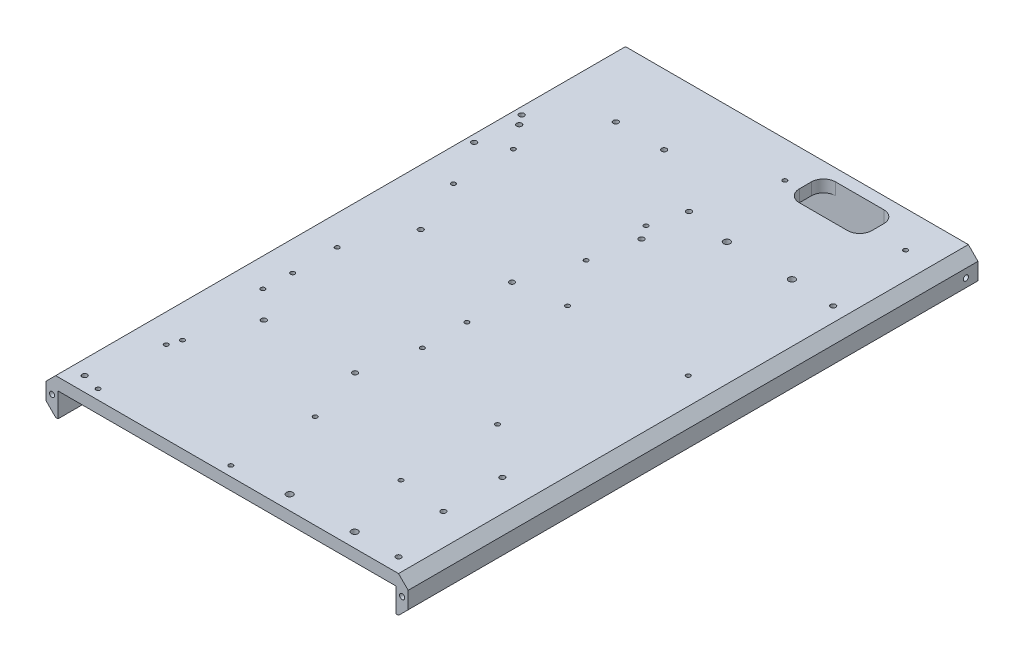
ISO-10303-21;
HEADER;
FILE_DESCRIPTION(('STEP AP214'),'2;1');
FILE_NAME('part.step','',(''),(''),'','','');
FILE_SCHEMA(('AUTOMOTIVE_DESIGN { 1 0 10303 214 1 1 1 1 }'));
ENDSEC;
DATA;
#1=APPLICATION_CONTEXT('core data for automotive mechanical design processes');
#2=APPLICATION_PROTOCOL_DEFINITION('international standard','automotive_design',2000,#1);
#3=PRODUCT_CONTEXT('',#1,'mechanical');
#4=PRODUCT('Part','Part','',(#3));
#5=PRODUCT_RELATED_PRODUCT_CATEGORY('part','',(#4));
#6=PRODUCT_DEFINITION_FORMATION('','',#4);
#7=PRODUCT_DEFINITION_CONTEXT('part definition',#1,'design');
#8=PRODUCT_DEFINITION('design','',#6,#7);
#9=PRODUCT_DEFINITION_SHAPE('','',#8);
#10=(LENGTH_UNIT() NAMED_UNIT(*) SI_UNIT(.MILLI.,.METRE.));
#11=(NAMED_UNIT(*) PLANE_ANGLE_UNIT() SI_UNIT($,.RADIAN.));
#12=(NAMED_UNIT(*) SI_UNIT($,.STERADIAN.) SOLID_ANGLE_UNIT());
#13=UNCERTAINTY_MEASURE_WITH_UNIT(LENGTH_MEASURE(1.E-05),#10,'distance_accuracy_value','');
#14=(GEOMETRIC_REPRESENTATION_CONTEXT(3) GLOBAL_UNCERTAINTY_ASSIGNED_CONTEXT((#13)) GLOBAL_UNIT_ASSIGNED_CONTEXT((#10,
#11,#12)) REPRESENTATION_CONTEXT('',''));
#15=CARTESIAN_POINT('',(0.,0.,0.));
#16=DIRECTION('',(0.,0.,1.));
#17=DIRECTION('',(1.,0.,0.));
#18=AXIS2_PLACEMENT_3D('',#15,#16,#17);
#19=CARTESIAN_POINT('',(-88.9,-6.35,6.35));
#20=DIRECTION('',(0.,0.,-1.));
#21=DIRECTION('',(-1.,0.,0.));
#22=AXIS2_PLACEMENT_3D('',#19,#20,#21);
#23=PLANE('',#22);
#24=CARTESIAN_POINT('',(76.2,-12.7,6.35));
#25=DIRECTION('',(0.,0.,1.));
#26=DIRECTION('',(1.,0.,0.));
#27=AXIS2_PLACEMENT_3D('',#24,#25,#26);
#28=CIRCLE('',#27,3.3782);
#29=CARTESIAN_POINT('',(79.5782,-12.7,6.35));
#30=VERTEX_POINT('',#29);
#31=EDGE_CURVE('E539',#30,#30,#28,.T.);
#32=ORIENTED_EDGE('',*,*,#31,.F.);
#33=EDGE_LOOP('',(#32));
#34=FACE_BOUND('',#33,.T.);
#35=DIRECTION('',(1.,0.,0.));
#36=VECTOR('',#35,1.);
#37=CARTESIAN_POINT('',(-88.9,-6.35,6.35));
#38=LINE('',#37,#36);
#39=CARTESIAN_POINT('',(52.07,-6.35,6.35));
#40=VERTEX_POINT('',#39);
#41=CARTESIAN_POINT('',(82.55,-6.35,6.35));
#42=VERTEX_POINT('',#41);
#43=EDGE_CURVE('E555',#40,#42,#38,.T.);
#44=ORIENTED_EDGE('',*,*,#43,.F.);
#45=DIRECTION('',(0.,-1.,0.));
#46=VECTOR('',#45,1.);
#47=CARTESIAN_POINT('',(52.07,0.,6.35));
#48=LINE('',#47,#46);
#49=CARTESIAN_POINT('',(52.07,0.,6.35000000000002));
#50=VERTEX_POINT('',#49);
#51=EDGE_CURVE('E531',#50,#40,#48,.T.);
#52=ORIENTED_EDGE('',*,*,#51,.F.);
#53=DIRECTION('',(1.,0.,0.));
#54=VECTOR('',#53,1.);
#55=CARTESIAN_POINT('',(26.67,0.,6.35));
#56=LINE('',#55,#54);
#57=CARTESIAN_POINT('',(26.67,0.,6.35));
#58=VERTEX_POINT('',#57);
#59=EDGE_CURVE('E490',#58,#50,#56,.T.);
#60=ORIENTED_EDGE('',*,*,#59,.F.);
#61=DIRECTION('',(0.,-1.,0.));
#62=VECTOR('',#61,1.);
#63=CARTESIAN_POINT('',(26.67,0.,6.35));
#64=LINE('',#63,#62);
#65=CARTESIAN_POINT('',(26.67,-6.35,6.35));
#66=VERTEX_POINT('',#65);
#67=EDGE_CURVE('E511',#58,#66,#64,.T.);
#68=ORIENTED_EDGE('',*,*,#67,.T.);
#69=CARTESIAN_POINT('',(-82.55,-6.35,6.35));
#70=VERTEX_POINT('',#69);
#71=EDGE_CURVE('E557',#70,#66,#38,.T.);
#72=ORIENTED_EDGE('',*,*,#71,.F.);
#73=DIRECTION('',(0.,-1.,0.));
#74=VECTOR('',#73,1.);
#75=CARTESIAN_POINT('',(-82.55,-19.05,6.35));
#76=LINE('',#75,#74);
#77=CARTESIAN_POINT('',(-82.55,-19.05,6.35));
#78=VERTEX_POINT('',#77);
#79=EDGE_CURVE('E639',#70,#78,#76,.T.);
#80=ORIENTED_EDGE('',*,*,#79,.T.);
#81=DIRECTION('',(1.,0.,0.));
#82=VECTOR('',#81,1.);
#83=CARTESIAN_POINT('',(-88.9,-19.05,6.35));
#84=LINE('',#83,#82);
#85=CARTESIAN_POINT('',(82.55,-19.05,6.35));
#86=VERTEX_POINT('',#85);
#87=EDGE_CURVE('E565',#78,#86,#84,.T.);
#88=ORIENTED_EDGE('',*,*,#87,.T.);
#89=DIRECTION('',(0.,-1.,0.));
#90=VECTOR('',#89,1.);
#91=CARTESIAN_POINT('',(82.55,-6.35,6.35));
#92=LINE('',#91,#90);
#93=EDGE_CURVE('E642',#86,#42,#92,.F.);
#94=ORIENTED_EDGE('',*,*,#93,.T.);
#95=EDGE_LOOP('',(#44,#52,#60,#68,#72,#80,#88,#94));
#96=FACE_BOUND('',#95,.T.);
#97=CARTESIAN_POINT('',(0.,-12.7,6.35));
#98=DIRECTION('',(0.,0.,1.));
#99=DIRECTION('',(1.,0.,0.));
#100=AXIS2_PLACEMENT_3D('',#97,#98,#99);
#101=CIRCLE('',#100,3.3782);
#102=CARTESIAN_POINT('',(3.3782,-12.7,6.35));
#103=VERTEX_POINT('',#102);
#104=EDGE_CURVE('E545',#103,#103,#101,.T.);
#105=ORIENTED_EDGE('',*,*,#104,.F.);
#106=EDGE_LOOP('',(#105));
#107=FACE_BOUND('',#106,.T.);
#108=CARTESIAN_POINT('',(-76.2,-12.7,6.35));
#109=DIRECTION('',(0.,0.,1.));
#110=DIRECTION('',(1.,0.,0.));
#111=AXIS2_PLACEMENT_3D('',#108,#109,#110);
#112=CIRCLE('',#111,3.3782);
#113=CARTESIAN_POINT('',(-72.8218,-12.7,6.35));
#114=VERTEX_POINT('',#113);
#115=EDGE_CURVE('E515',#114,#114,#112,.T.);
#116=ORIENTED_EDGE('',*,*,#115,.F.);
#117=EDGE_LOOP('',(#116));
#118=FACE_BOUND('',#117,.T.);
#119=ADVANCED_FACE('F57',(#34,#96,#107,#118),#23,.F.);
#120=CARTESIAN_POINT('',(-95.25,0.,299.72));
#121=DIRECTION('',(1.,0.,0.));
#122=DIRECTION('',(0.,0.,-1.));
#123=AXIS2_PLACEMENT_3D('',#120,#121,#122);
#124=PLANE('',#123);
#125=CARTESIAN_POINT('',(-95.25,-9.525,6.35));
#126=DIRECTION('',(-1.,0.,0.));
#127=DIRECTION('',(0.,0.,1.));
#128=AXIS2_PLACEMENT_3D('',#125,#126,#127);
#129=CIRCLE('',#128,1.35255);
#130=CARTESIAN_POINT('',(-95.25,-9.525,7.70255));
#131=VERTEX_POINT('',#130);
#132=EDGE_CURVE('E259',#131,#131,#129,.T.);
#133=ORIENTED_EDGE('',*,*,#132,.F.);
#134=EDGE_LOOP('',(#133));
#135=FACE_BOUND('',#134,.T.);
#136=DIRECTION('',(0.,-1.,0.));
#137=VECTOR('',#136,1.);
#138=CARTESIAN_POINT('',(-95.25,0.,299.72));
#139=LINE('',#138,#137);
#140=CARTESIAN_POINT('',(-95.25,-5.07999999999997,299.72));
#141=VERTEX_POINT('',#140);
#142=CARTESIAN_POINT('',(-95.25,-13.97,299.72));
#143=VERTEX_POINT('',#142);
#144=EDGE_CURVE('E568',#141,#143,#139,.T.);
#145=ORIENTED_EDGE('',*,*,#144,.F.);
#146=DIRECTION('',(0.,0.,-1.));
#147=VECTOR('',#146,1.);
#148=CARTESIAN_POINT('',(-95.25,-5.07999999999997,299.72));
#149=LINE('',#148,#147);
#150=CARTESIAN_POINT('',(-95.25,-5.07999999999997,0.));
#151=VERTEX_POINT('',#150);
#152=EDGE_CURVE('E602',#141,#151,#149,.T.);
#153=ORIENTED_EDGE('',*,*,#152,.T.);
#154=DIRECTION('',(0.,-1.,0.));
#155=VECTOR('',#154,1.);
#156=CARTESIAN_POINT('',(-95.25,0.,0.));
#157=LINE('',#156,#155);
#158=CARTESIAN_POINT('',(-95.25,-13.97,0.));
#159=VERTEX_POINT('',#158);
#160=EDGE_CURVE('E562',#151,#159,#157,.T.);
#161=ORIENTED_EDGE('',*,*,#160,.T.);
#162=DIRECTION('',(0.,0.,1.));
#163=VECTOR('',#162,1.);
#164=CARTESIAN_POINT('',(-95.25,-13.97,299.72));
#165=LINE('',#164,#163);
#166=EDGE_CURVE('E600',#159,#143,#165,.T.);
#167=ORIENTED_EDGE('',*,*,#166,.T.);
#168=EDGE_LOOP('',(#145,#153,#161,#167));
#169=FACE_BOUND('',#168,.T.);
#170=ADVANCED_FACE('F922',(#135,#169),#124,.F.);
#171=CARTESIAN_POINT('',(-95.25,-19.05,299.72));
#172=DIRECTION('',(0.,1.,0.));
#173=DIRECTION('',(-1.,0.,0.));
#174=AXIS2_PLACEMENT_3D('',#171,#172,#173);
#175=PLANE('',#174);
#176=DIRECTION('',(1.,0.,0.));
#177=VECTOR('',#176,1.);
#178=CARTESIAN_POINT('',(-95.25,-19.05,0.));
#179=LINE('',#178,#177);
#180=CARTESIAN_POINT('',(-90.1700000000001,-19.05,0.));
#181=VERTEX_POINT('',#180);
#182=CARTESIAN_POINT('',(90.1699999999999,-19.05,0.));
#183=VERTEX_POINT('',#182);
#184=EDGE_CURVE('E584',#181,#183,#179,.T.);
#185=ORIENTED_EDGE('',*,*,#184,.T.);
#186=DIRECTION('',(0.,0.,1.));
#187=VECTOR('',#186,1.);
#188=CARTESIAN_POINT('',(90.1699999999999,-19.05,299.72));
#189=LINE('',#188,#187);
#190=CARTESIAN_POINT('',(90.1699999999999,-19.05,299.72));
#191=VERTEX_POINT('',#190);
#192=EDGE_CURVE('E634',#183,#191,#189,.T.);
#193=ORIENTED_EDGE('',*,*,#192,.T.);
#194=DIRECTION('',(1.,0.,0.));
#195=VECTOR('',#194,1.);
#196=CARTESIAN_POINT('',(-95.25,-19.05,299.72));
#197=LINE('',#196,#195);
#198=CARTESIAN_POINT('',(88.9,-19.05,299.72));
#199=VERTEX_POINT('',#198);
#200=EDGE_CURVE('E571',#199,#191,#197,.T.);
#201=ORIENTED_EDGE('',*,*,#200,.F.);
#202=DIRECTION('',(0.,0.,1.));
#203=VECTOR('',#202,1.);
#204=CARTESIAN_POINT('',(88.9,-19.05,313.041161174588));
#205=LINE('',#204,#203);
#206=CARTESIAN_POINT('',(88.9,-19.05,12.7));
#207=VERTEX_POINT('',#206);
#208=EDGE_CURVE('E556',#207,#199,#205,.T.);
#209=ORIENTED_EDGE('',*,*,#208,.F.);
#210=CARTESIAN_POINT('',(82.55,-19.05,12.7));
#211=DIRECTION('',(0.,1.,0.));
#212=DIRECTION('',(-1.,0.,0.));
#213=AXIS2_PLACEMENT_3D('',#210,#211,#212);
#214=CIRCLE('',#213,6.35);
#215=EDGE_CURVE('E651',#207,#86,#214,.T.);
#216=ORIENTED_EDGE('',*,*,#215,.T.);
#217=ORIENTED_EDGE('',*,*,#87,.F.);
#218=CARTESIAN_POINT('',(-82.55,-19.05,12.7));
#219=DIRECTION('',(0.,1.,0.));
#220=DIRECTION('',(-1.,0.,0.));
#221=AXIS2_PLACEMENT_3D('',#218,#219,#220);
#222=CIRCLE('',#221,6.35);
#223=CARTESIAN_POINT('',(-88.9,-19.05,12.7));
#224=VERTEX_POINT('',#223);
#225=EDGE_CURVE('E654',#78,#224,#222,.T.);
#226=ORIENTED_EDGE('',*,*,#225,.T.);
#227=DIRECTION('',(0.,0.,-1.));
#228=VECTOR('',#227,1.);
#229=CARTESIAN_POINT('',(-88.9,-19.05,313.041161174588));
#230=LINE('',#229,#228);
#231=CARTESIAN_POINT('',(-88.9,-19.05,299.72));
#232=VERTEX_POINT('',#231);
#233=EDGE_CURVE('E551',#232,#224,#230,.T.);
#234=ORIENTED_EDGE('',*,*,#233,.F.);
#235=CARTESIAN_POINT('',(-90.1700000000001,-19.05,299.72));
#236=VERTEX_POINT('',#235);
#237=EDGE_CURVE('E573',#236,#232,#197,.T.);
#238=ORIENTED_EDGE('',*,*,#237,.F.);
#239=DIRECTION('',(0.,0.,-1.));
#240=VECTOR('',#239,1.);
#241=CARTESIAN_POINT('',(-90.1700000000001,-19.05,299.72));
#242=LINE('',#241,#240);
#243=EDGE_CURVE('E631',#236,#181,#242,.T.);
#244=ORIENTED_EDGE('',*,*,#243,.T.);
#245=EDGE_LOOP('',(#185,#193,#201,#209,#216,#217,#226,#234,#238,#244));
#246=FACE_BOUND('',#245,.T.);
#247=ADVANCED_FACE('F942',(#246),#175,.F.);
#248=CARTESIAN_POINT('',(95.25,0.,299.72));
#249=DIRECTION('',(-1.,0.,0.));
#250=DIRECTION('',(0.,0.,1.));
#251=AXIS2_PLACEMENT_3D('',#248,#249,#250);
#252=PLANE('',#251);
#253=CARTESIAN_POINT('',(95.25,-9.525,6.35));
#254=DIRECTION('',(1.,0.,0.));
#255=DIRECTION('',(0.,0.,-1.));
#256=AXIS2_PLACEMENT_3D('',#253,#254,#255);
#257=CIRCLE('',#256,1.35255);
#258=CARTESIAN_POINT('',(95.25,-9.525,4.99745));
#259=VERTEX_POINT('',#258);
#260=EDGE_CURVE('E255',#259,#259,#257,.T.);
#261=ORIENTED_EDGE('',*,*,#260,.F.);
#262=EDGE_LOOP('',(#261));
#263=FACE_BOUND('',#262,.T.);
#264=DIRECTION('',(0.,1.,0.));
#265=VECTOR('',#264,1.);
#266=CARTESIAN_POINT('',(95.25,0.,0.));
#267=LINE('',#266,#265);
#268=CARTESIAN_POINT('',(95.25,-13.97,0.));
#269=VERTEX_POINT('',#268);
#270=CARTESIAN_POINT('',(95.25,-5.07999999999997,0.));
#271=VERTEX_POINT('',#270);
#272=EDGE_CURVE('E587',#269,#271,#267,.T.);
#273=ORIENTED_EDGE('',*,*,#272,.T.);
#274=DIRECTION('',(0.,0.,1.));
#275=VECTOR('',#274,1.);
#276=CARTESIAN_POINT('',(95.25,-5.07999999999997,299.72));
#277=LINE('',#276,#275);
#278=CARTESIAN_POINT('',(95.25,-5.07999999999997,299.72));
#279=VERTEX_POINT('',#278);
#280=EDGE_CURVE('E629',#271,#279,#277,.T.);
#281=ORIENTED_EDGE('',*,*,#280,.T.);
#282=DIRECTION('',(0.,1.,0.));
#283=VECTOR('',#282,1.);
#284=CARTESIAN_POINT('',(95.25,0.,299.72));
#285=LINE('',#284,#283);
#286=CARTESIAN_POINT('',(95.25,-13.97,299.72));
#287=VERTEX_POINT('',#286);
#288=EDGE_CURVE('E575',#287,#279,#285,.T.);
#289=ORIENTED_EDGE('',*,*,#288,.F.);
#290=DIRECTION('',(0.,0.,-1.));
#291=VECTOR('',#290,1.);
#292=CARTESIAN_POINT('',(95.25,-13.97,299.72));
#293=LINE('',#292,#291);
#294=EDGE_CURVE('E626',#287,#269,#293,.T.);
#295=ORIENTED_EDGE('',*,*,#294,.T.);
#296=EDGE_LOOP('',(#273,#281,#289,#295));
#297=FACE_BOUND('',#296,.T.);
#298=ADVANCED_FACE('F938',(#263,#297),#252,.F.);
#299=CARTESIAN_POINT('',(-95.25,0.,299.72));
#300=DIRECTION('',(0.,-1.,0.));
#301=DIRECTION('',(0.,0.,-1.));
#302=AXIS2_PLACEMENT_3D('',#299,#300,#301);
#303=PLANE('',#302);
#304=CARTESIAN_POINT('',(-86.36,0.,58.42));
#305=DIRECTION('',(0.,1.,0.));
#306=DIRECTION('',(0.,0.,1.));
#307=AXIS2_PLACEMENT_3D('',#304,#305,#306);
#308=CIRCLE('',#307,1.35254999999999);
#309=CARTESIAN_POINT('',(-86.36,0.,59.77255));
#310=VERTEX_POINT('',#309);
#311=EDGE_CURVE('E263',#310,#310,#308,.T.);
#312=ORIENTED_EDGE('',*,*,#311,.F.);
#313=EDGE_LOOP('',(#312));
#314=FACE_BOUND('',#313,.T.);
#315=CARTESIAN_POINT('',(1.64000000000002,0.,83.42));
#316=DIRECTION('',(0.,1.,0.));
#317=DIRECTION('',(0.,0.,1.));
#318=AXIS2_PLACEMENT_3D('',#315,#316,#317);
#319=CIRCLE('',#318,1.35255);
#320=CARTESIAN_POINT('',(1.64000000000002,0.,84.77255));
#321=VERTEX_POINT('',#320);
#322=EDGE_CURVE('E269',#321,#321,#319,.T.);
#323=ORIENTED_EDGE('',*,*,#322,.F.);
#324=EDGE_LOOP('',(#323));
#325=FACE_BOUND('',#324,.T.);
#326=CARTESIAN_POINT('',(-86.36,0.,83.42));
#327=DIRECTION('',(0.,1.,0.));
#328=DIRECTION('',(0.,0.,1.));
#329=AXIS2_PLACEMENT_3D('',#326,#327,#328);
#330=CIRCLE('',#329,1.35254999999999);
#331=CARTESIAN_POINT('',(-86.36,0.,84.77255));
#332=VERTEX_POINT('',#331);
#333=EDGE_CURVE('E273',#332,#332,#330,.T.);
#334=ORIENTED_EDGE('',*,*,#333,.F.);
#335=EDGE_LOOP('',(#334));
#336=FACE_BOUND('',#335,.T.);
#337=CARTESIAN_POINT('',(1.64000000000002,0.,58.42));
#338=DIRECTION('',(0.,1.,0.));
#339=DIRECTION('',(0.,0.,1.));
#340=AXIS2_PLACEMENT_3D('',#337,#338,#339);
#341=CIRCLE('',#340,1.35255);
#342=CARTESIAN_POINT('',(1.64000000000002,0.,59.77255));
#343=VERTEX_POINT('',#342);
#344=EDGE_CURVE('E277',#343,#343,#341,.T.);
#345=ORIENTED_EDGE('',*,*,#344,.F.);
#346=EDGE_LOOP('',(#345));
#347=FACE_BOUND('',#346,.T.);
#348=CARTESIAN_POINT('',(12.7,0.,19.05));
#349=DIRECTION('',(0.,1.,0.));
#350=DIRECTION('',(0.,0.,1.));
#351=AXIS2_PLACEMENT_3D('',#348,#349,#350);
#352=CIRCLE('',#351,1.1303);
#353=CARTESIAN_POINT('',(12.7,0.,20.1803));
#354=VERTEX_POINT('',#353);
#355=EDGE_CURVE('E283',#354,#354,#352,.T.);
#356=ORIENTED_EDGE('',*,*,#355,.F.);
#357=EDGE_LOOP('',(#356));
#358=FACE_BOUND('',#357,.T.);
#359=CARTESIAN_POINT('',(12.7,0.,133.35));
#360=DIRECTION('',(0.,1.,0.));
#361=DIRECTION('',(0.,0.,1.));
#362=AXIS2_PLACEMENT_3D('',#359,#360,#361);
#363=CIRCLE('',#362,1.1303);
#364=CARTESIAN_POINT('',(12.7,0.,134.4803));
#365=VERTEX_POINT('',#364);
#366=EDGE_CURVE('E287',#365,#365,#363,.T.);
#367=ORIENTED_EDGE('',*,*,#366,.F.);
#368=EDGE_LOOP('',(#367));
#369=FACE_BOUND('',#368,.T.);
#370=CARTESIAN_POINT('',(76.2,0.,19.05));
#371=DIRECTION('',(0.,1.,0.));
#372=DIRECTION('',(0.,0.,1.));
#373=AXIS2_PLACEMENT_3D('',#370,#371,#372);
#374=CIRCLE('',#373,1.1303);
#375=CARTESIAN_POINT('',(76.2,0.,20.1803));
#376=VERTEX_POINT('',#375);
#377=EDGE_CURVE('E291',#376,#376,#374,.T.);
#378=ORIENTED_EDGE('',*,*,#377,.F.);
#379=EDGE_LOOP('',(#378));
#380=FACE_BOUND('',#379,.T.);
#381=CARTESIAN_POINT('',(76.2,0.,133.35));
#382=DIRECTION('',(0.,1.,0.));
#383=DIRECTION('',(0.,0.,1.));
#384=AXIS2_PLACEMENT_3D('',#381,#382,#383);
#385=CIRCLE('',#384,1.1303);
#386=CARTESIAN_POINT('',(76.2,0.,134.4803));
#387=VERTEX_POINT('',#386);
#388=EDGE_CURVE('E295',#387,#387,#385,.T.);
#389=ORIENTED_EDGE('',*,*,#388,.F.);
#390=EDGE_LOOP('',(#389));
#391=FACE_BOUND('',#390,.T.);
#392=CARTESIAN_POINT('',(73.66,0.,259.6));
#393=DIRECTION('',(0.,1.,0.));
#394=DIRECTION('',(0.,0.,1.));
#395=AXIS2_PLACEMENT_3D('',#392,#393,#394);
#396=CIRCLE('',#395,1.35254999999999);
#397=CARTESIAN_POINT('',(73.66,0.,260.95255));
#398=VERTEX_POINT('',#397);
#399=EDGE_CURVE('E299',#398,#398,#396,.T.);
#400=ORIENTED_EDGE('',*,*,#399,.F.);
#401=EDGE_LOOP('',(#400));
#402=FACE_BOUND('',#401,.T.);
#403=CARTESIAN_POINT('',(73.66,0.,228.6));
#404=DIRECTION('',(0.,1.,0.));
#405=DIRECTION('',(0.,0.,1.));
#406=AXIS2_PLACEMENT_3D('',#403,#404,#405);
#407=CIRCLE('',#406,1.35254999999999);
#408=CARTESIAN_POINT('',(73.66,0.,229.95255));
#409=VERTEX_POINT('',#408);
#410=EDGE_CURVE('E305',#409,#409,#407,.T.);
#411=ORIENTED_EDGE('',*,*,#410,.F.);
#412=EDGE_LOOP('',(#411));
#413=FACE_BOUND('',#412,.T.);
#414=CARTESIAN_POINT('',(-75.184,0.,205.74));
#415=DIRECTION('',(0.,1.,0.));
#416=DIRECTION('',(0.,0.,1.));
#417=AXIS2_PLACEMENT_3D('',#414,#415,#416);
#418=CIRCLE('',#417,1.13029999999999);
#419=CARTESIAN_POINT('',(-75.184,0.,206.8703));
#420=VERTEX_POINT('',#419);
#421=EDGE_CURVE('E309',#420,#420,#418,.T.);
#422=ORIENTED_EDGE('',*,*,#421,.F.);
#423=EDGE_LOOP('',(#422));
#424=FACE_BOUND('',#423,.T.);
#425=CARTESIAN_POINT('',(48.26,0.,256.54));
#426=DIRECTION('',(0.,1.,0.));
#427=DIRECTION('',(0.,0.,1.));
#428=AXIS2_PLACEMENT_3D('',#425,#426,#427);
#429=CIRCLE('',#428,1.13029999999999);
#430=CARTESIAN_POINT('',(48.26,0.,257.6703));
#431=VERTEX_POINT('',#430);
#432=EDGE_CURVE('E315',#431,#431,#429,.T.);
#433=ORIENTED_EDGE('',*,*,#432,.F.);
#434=EDGE_LOOP('',(#433));
#435=FACE_BOUND('',#434,.T.);
#436=CARTESIAN_POINT('',(-75.184,0.,256.54));
#437=DIRECTION('',(0.,1.,0.));
#438=DIRECTION('',(0.,0.,1.));
#439=AXIS2_PLACEMENT_3D('',#436,#437,#438);
#440=CIRCLE('',#439,1.13029999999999);
#441=CARTESIAN_POINT('',(-75.184,0.,257.6703));
#442=VERTEX_POINT('',#441);
#443=EDGE_CURVE('E321',#442,#442,#440,.T.);
#444=ORIENTED_EDGE('',*,*,#443,.F.);
#445=EDGE_LOOP('',(#444));
#446=FACE_BOUND('',#445,.T.);
#447=CARTESIAN_POINT('',(48.26,0.,205.74));
#448=DIRECTION('',(0.,1.,0.));
#449=DIRECTION('',(0.,0.,1.));
#450=AXIS2_PLACEMENT_3D('',#447,#448,#449);
#451=CIRCLE('',#450,1.13029999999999);
#452=CARTESIAN_POINT('',(48.26,0.,206.8703));
#453=VERTEX_POINT('',#452);
#454=EDGE_CURVE('E327',#453,#453,#451,.T.);
#455=ORIENTED_EDGE('',*,*,#454,.F.);
#456=EDGE_LOOP('',(#455));
#457=FACE_BOUND('',#456,.T.);
#458=CARTESIAN_POINT('',(-12.7,0.,137.16));
#459=DIRECTION('',(0.,-1.,0.));
#460=DIRECTION('',(0.,0.,-1.));
#461=AXIS2_PLACEMENT_3D('',#458,#459,#460);
#462=CIRCLE('',#461,1.35255);
#463=CARTESIAN_POINT('',(-12.7,0.,135.80745));
#464=VERTEX_POINT('',#463);
#465=EDGE_CURVE('E334',#464,#464,#462,.T.);
#466=ORIENTED_EDGE('',*,*,#465,.T.);
#467=EDGE_LOOP('',(#466));
#468=FACE_BOUND('',#467,.T.);
#469=CARTESIAN_POINT('',(-60.7,0.,137.16));
#470=DIRECTION('',(0.,-1.,0.));
#471=DIRECTION('',(0.,0.,-1.));
#472=AXIS2_PLACEMENT_3D('',#469,#470,#471);
#473=CIRCLE('',#472,1.35255);
#474=CARTESIAN_POINT('',(-60.7,0.,135.80745));
#475=VERTEX_POINT('',#474);
#476=EDGE_CURVE('E340',#475,#475,#473,.T.);
#477=ORIENTED_EDGE('',*,*,#476,.T.);
#478=EDGE_LOOP('',(#477));
#479=FACE_BOUND('',#478,.T.);
#480=CARTESIAN_POINT('',(-12.7,0.,219.71));
#481=DIRECTION('',(0.,-1.,0.));
#482=DIRECTION('',(0.,0.,-1.));
#483=AXIS2_PLACEMENT_3D('',#480,#481,#482);
#484=CIRCLE('',#483,1.35255);
#485=CARTESIAN_POINT('',(-12.7,0.,218.35745));
#486=VERTEX_POINT('',#485);
#487=EDGE_CURVE('E346',#486,#486,#484,.T.);
#488=ORIENTED_EDGE('',*,*,#487,.T.);
#489=EDGE_LOOP('',(#488));
#490=FACE_BOUND('',#489,.T.);
#491=CARTESIAN_POINT('',(-60.7,0.,219.71));
#492=DIRECTION('',(0.,-1.,0.));
#493=DIRECTION('',(0.,0.,-1.));
#494=AXIS2_PLACEMENT_3D('',#491,#492,#493);
#495=CIRCLE('',#494,1.35255);
#496=CARTESIAN_POINT('',(-60.7,0.,218.35745));
#497=VERTEX_POINT('',#496);
#498=EDGE_CURVE('E352',#497,#497,#495,.T.);
#499=ORIENTED_EDGE('',*,*,#498,.T.);
#500=EDGE_LOOP('',(#499));
#501=FACE_BOUND('',#500,.T.);
#502=CARTESIAN_POINT('',(-72.9750000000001,0.,294.59));
#503=DIRECTION('',(0.,-1.,0.));
#504=DIRECTION('',(0.,0.,-1.));
#505=AXIS2_PLACEMENT_3D('',#502,#503,#504);
#506=CIRCLE('',#505,1.1303);
#507=CARTESIAN_POINT('',(-72.9750000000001,0.,293.4597));
#508=VERTEX_POINT('',#507);
#509=EDGE_CURVE('E358',#508,#508,#506,.T.);
#510=ORIENTED_EDGE('',*,*,#509,.T.);
#511=EDGE_LOOP('',(#510));
#512=FACE_BOUND('',#511,.T.);
#513=CARTESIAN_POINT('',(-3.17500000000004,0.,250.19));
#514=DIRECTION('',(0.,-1.,0.));
#515=DIRECTION('',(0.,0.,-1.));
#516=AXIS2_PLACEMENT_3D('',#513,#514,#515);
#517=CIRCLE('',#516,1.1303);
#518=CARTESIAN_POINT('',(-3.17500000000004,0.,249.0597));
#519=VERTEX_POINT('',#518);
#520=EDGE_CURVE('E364',#519,#519,#517,.T.);
#521=ORIENTED_EDGE('',*,*,#520,.T.);
#522=EDGE_LOOP('',(#521));
#523=FACE_BOUND('',#522,.T.);
#524=CARTESIAN_POINT('',(-72.975,0.,250.19));
#525=DIRECTION('',(0.,-1.,0.));
#526=DIRECTION('',(0.,0.,-1.));
#527=AXIS2_PLACEMENT_3D('',#524,#525,#526);
#528=CIRCLE('',#527,1.1303);
#529=CARTESIAN_POINT('',(-72.975,0.,249.0597));
#530=VERTEX_POINT('',#529);
#531=EDGE_CURVE('E370',#530,#530,#528,.T.);
#532=ORIENTED_EDGE('',*,*,#531,.T.);
#533=EDGE_LOOP('',(#532));
#534=FACE_BOUND('',#533,.T.);
#535=CARTESIAN_POINT('',(-3.17500000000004,0.,294.59));
#536=DIRECTION('',(0.,-1.,0.));
#537=DIRECTION('',(0.,0.,-1.));
#538=AXIS2_PLACEMENT_3D('',#535,#536,#537);
#539=CIRCLE('',#538,1.1303);
#540=CARTESIAN_POINT('',(-3.17500000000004,0.,293.4597));
#541=VERTEX_POINT('',#540);
#542=EDGE_CURVE('E376',#541,#541,#539,.T.);
#543=ORIENTED_EDGE('',*,*,#542,.T.);
#544=EDGE_LOOP('',(#543));
#545=FACE_BOUND('',#544,.T.);
#546=CARTESIAN_POINT('',(-72.975,0.,107.7));
#547=DIRECTION('',(0.,-1.,0.));
#548=DIRECTION('',(0.,0.,-1.));
#549=AXIS2_PLACEMENT_3D('',#546,#547,#548);
#550=CIRCLE('',#549,1.1303);
#551=CARTESIAN_POINT('',(-72.975,0.,106.5697));
#552=VERTEX_POINT('',#551);
#553=EDGE_CURVE('E382',#552,#552,#550,.T.);
#554=ORIENTED_EDGE('',*,*,#553,.T.);
#555=EDGE_LOOP('',(#554));
#556=FACE_BOUND('',#555,.T.);
#557=CARTESIAN_POINT('',(-3.17500000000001,0.,76.2));
#558=DIRECTION('',(0.,-1.,0.));
#559=DIRECTION('',(0.,0.,-1.));
#560=AXIS2_PLACEMENT_3D('',#557,#558,#559);
#561=CIRCLE('',#560,1.1303);
#562=CARTESIAN_POINT('',(-3.17500000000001,0.,75.0697));
#563=VERTEX_POINT('',#562);
#564=EDGE_CURVE('E388',#563,#563,#561,.T.);
#565=ORIENTED_EDGE('',*,*,#564,.T.);
#566=EDGE_LOOP('',(#565));
#567=FACE_BOUND('',#566,.T.);
#568=CARTESIAN_POINT('',(-72.975,0.,76.2));
#569=DIRECTION('',(0.,-1.,0.));
#570=DIRECTION('',(0.,0.,-1.));
#571=AXIS2_PLACEMENT_3D('',#568,#569,#570);
#572=CIRCLE('',#571,1.1303);
#573=CARTESIAN_POINT('',(-72.975,0.,75.0697));
#574=VERTEX_POINT('',#573);
#575=EDGE_CURVE('E394',#574,#574,#572,.T.);
#576=ORIENTED_EDGE('',*,*,#575,.T.);
#577=EDGE_LOOP('',(#576));
#578=FACE_BOUND('',#577,.T.);
#579=CARTESIAN_POINT('',(-3.17500000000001,0.,107.7));
#580=DIRECTION('',(0.,-1.,0.));
#581=DIRECTION('',(0.,0.,-1.));
#582=AXIS2_PLACEMENT_3D('',#579,#580,#581);
#583=CIRCLE('',#582,1.1303);
#584=CARTESIAN_POINT('',(-3.17500000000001,0.,106.5697));
#585=VERTEX_POINT('',#584);
#586=EDGE_CURVE('E400',#585,#585,#583,.T.);
#587=ORIENTED_EDGE('',*,*,#586,.T.);
#588=EDGE_LOOP('',(#587));
#589=FACE_BOUND('',#588,.T.);
#590=CARTESIAN_POINT('',(-74.55,0.,190.659));
#591=DIRECTION('',(0.,-1.,0.));
#592=DIRECTION('',(0.,0.,-1.));
#593=AXIS2_PLACEMENT_3D('',#590,#591,#592);
#594=CIRCLE('',#593,1.1303);
#595=CARTESIAN_POINT('',(-74.55,0.,189.5287));
#596=VERTEX_POINT('',#595);
#597=EDGE_CURVE('E406',#596,#596,#594,.T.);
#598=ORIENTED_EDGE('',*,*,#597,.T.);
#599=EDGE_LOOP('',(#598));
#600=FACE_BOUND('',#599,.T.);
#601=CARTESIAN_POINT('',(-6.35000000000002,0.,167.259));
#602=DIRECTION('',(0.,-1.,0.));
#603=DIRECTION('',(0.,0.,-1.));
#604=AXIS2_PLACEMENT_3D('',#601,#602,#603);
#605=CIRCLE('',#604,1.1303);
#606=CARTESIAN_POINT('',(-6.35000000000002,0.,166.1287));
#607=VERTEX_POINT('',#606);
#608=EDGE_CURVE('E412',#607,#607,#605,.T.);
#609=ORIENTED_EDGE('',*,*,#608,.T.);
#610=EDGE_LOOP('',(#609));
#611=FACE_BOUND('',#610,.T.);
#612=CARTESIAN_POINT('',(-74.55,0.,167.259));
#613=DIRECTION('',(0.,-1.,0.));
#614=DIRECTION('',(0.,0.,-1.));
#615=AXIS2_PLACEMENT_3D('',#612,#613,#614);
#616=CIRCLE('',#615,1.1303);
#617=CARTESIAN_POINT('',(-74.55,0.,166.1287));
#618=VERTEX_POINT('',#617);
#619=EDGE_CURVE('E418',#618,#618,#616,.T.);
#620=ORIENTED_EDGE('',*,*,#619,.T.);
#621=EDGE_LOOP('',(#620));
#622=FACE_BOUND('',#621,.T.);
#623=CARTESIAN_POINT('',(-6.35000000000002,0.,190.659));
#624=DIRECTION('',(0.,-1.,0.));
#625=DIRECTION('',(0.,0.,-1.));
#626=AXIS2_PLACEMENT_3D('',#623,#624,#625);
#627=CIRCLE('',#626,1.1303);
#628=CARTESIAN_POINT('',(-6.35000000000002,0.,189.5287));
#629=VERTEX_POINT('',#628);
#630=EDGE_CURVE('E424',#629,#629,#627,.T.);
#631=ORIENTED_EDGE('',*,*,#630,.T.);
#632=EDGE_LOOP('',(#631));
#633=FACE_BOUND('',#632,.T.);
#634=CARTESIAN_POINT('',(82.55,0.,63.5));
#635=DIRECTION('',(0.,-1.,0.));
#636=DIRECTION('',(0.,0.,-1.));
#637=AXIS2_PLACEMENT_3D('',#634,#635,#636);
#638=CIRCLE('',#637,1.35254999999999);
#639=CARTESIAN_POINT('',(82.55,0.,62.14745));
#640=VERTEX_POINT('',#639);
#641=EDGE_CURVE('E430',#640,#640,#638,.T.);
#642=ORIENTED_EDGE('',*,*,#641,.T.);
#643=EDGE_LOOP('',(#642));
#644=FACE_BOUND('',#643,.T.);
#645=CARTESIAN_POINT('',(-82.55,0.,292.1));
#646=DIRECTION('',(0.,-1.,0.));
#647=DIRECTION('',(0.,0.,-1.));
#648=AXIS2_PLACEMENT_3D('',#645,#646,#647);
#649=CIRCLE('',#648,1.35254999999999);
#650=CARTESIAN_POINT('',(-82.55,0.,290.74745));
#651=VERTEX_POINT('',#650);
#652=EDGE_CURVE('E436',#651,#651,#649,.T.);
#653=ORIENTED_EDGE('',*,*,#652,.T.);
#654=EDGE_LOOP('',(#653));
#655=FACE_BOUND('',#654,.T.);
#656=CARTESIAN_POINT('',(82.55,0.,292.1));
#657=DIRECTION('',(0.,-1.,0.));
#658=DIRECTION('',(0.,0.,-1.));
#659=AXIS2_PLACEMENT_3D('',#656,#657,#658);
#660=CIRCLE('',#659,1.35254999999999);
#661=CARTESIAN_POINT('',(82.55,0.,290.74745));
#662=VERTEX_POINT('',#661);
#663=EDGE_CURVE('E442',#662,#662,#660,.T.);
#664=ORIENTED_EDGE('',*,*,#663,.T.);
#665=EDGE_LOOP('',(#664));
#666=FACE_BOUND('',#665,.T.);
#667=CARTESIAN_POINT('',(-82.55,0.,63.5));
#668=DIRECTION('',(0.,-1.,0.));
#669=DIRECTION('',(0.,0.,-1.));
#670=AXIS2_PLACEMENT_3D('',#667,#668,#669);
#671=CIRCLE('',#670,1.35254999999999);
#672=CARTESIAN_POINT('',(-82.55,0.,62.14745));
#673=VERTEX_POINT('',#672);
#674=EDGE_CURVE('E448',#673,#673,#671,.T.);
#675=ORIENTED_EDGE('',*,*,#674,.T.);
#676=EDGE_LOOP('',(#675));
#677=FACE_BOUND('',#676,.T.);
#678=CARTESIAN_POINT('',(25.4,0.,292.23));
#679=DIRECTION('',(0.,-1.,0.));
#680=DIRECTION('',(0.,0.,-1.));
#681=AXIS2_PLACEMENT_3D('',#678,#679,#680);
#682=CIRCLE('',#681,1.7272);
#683=CARTESIAN_POINT('',(25.4,0.,290.5028));
#684=VERTEX_POINT('',#683);
#685=EDGE_CURVE('E454',#684,#684,#682,.T.);
#686=ORIENTED_EDGE('',*,*,#685,.T.);
#687=EDGE_LOOP('',(#686));
#688=FACE_BOUND('',#687,.T.);
#689=CARTESIAN_POINT('',(59.6,0.,62.23));
#690=DIRECTION('',(0.,-1.,0.));
#691=DIRECTION('',(0.,0.,-1.));
#692=AXIS2_PLACEMENT_3D('',#689,#690,#691);
#693=CIRCLE('',#692,1.7272);
#694=CARTESIAN_POINT('',(59.6,0.,60.5028));
#695=VERTEX_POINT('',#694);
#696=EDGE_CURVE('E460',#695,#695,#693,.T.);
#697=ORIENTED_EDGE('',*,*,#696,.T.);
#698=EDGE_LOOP('',(#697));
#699=FACE_BOUND('',#698,.T.);
#700=CARTESIAN_POINT('',(25.4,0.,62.23));
#701=DIRECTION('',(0.,-1.,0.));
#702=DIRECTION('',(0.,0.,-1.));
#703=AXIS2_PLACEMENT_3D('',#700,#701,#702);
#704=CIRCLE('',#703,1.7272);
#705=CARTESIAN_POINT('',(25.4,0.,60.5028));
#706=VERTEX_POINT('',#705);
#707=EDGE_CURVE('E466',#706,#706,#704,.T.);
#708=ORIENTED_EDGE('',*,*,#707,.T.);
#709=EDGE_LOOP('',(#708));
#710=FACE_BOUND('',#709,.T.);
#711=CARTESIAN_POINT('',(59.6,0.,292.23));
#712=DIRECTION('',(0.,-1.,0.));
#713=DIRECTION('',(0.,0.,-1.));
#714=AXIS2_PLACEMENT_3D('',#711,#712,#713);
#715=CIRCLE('',#714,1.7272);
#716=CARTESIAN_POINT('',(59.6,0.,290.5028));
#717=VERTEX_POINT('',#716);
#718=EDGE_CURVE('E472',#717,#717,#715,.T.);
#719=ORIENTED_EDGE('',*,*,#718,.T.);
#720=EDGE_LOOP('',(#719));
#721=FACE_BOUND('',#720,.T.);
#722=CARTESIAN_POINT('',(-58.42,0.,36.83));
#723=DIRECTION('',(0.,-1.,0.));
#724=DIRECTION('',(0.,0.,-1.));
#725=AXIS2_PLACEMENT_3D('',#722,#723,#724);
#726=CIRCLE('',#725,1.35255);
#727=CARTESIAN_POINT('',(-58.42,0.,35.47745));
#728=VERTEX_POINT('',#727);
#729=EDGE_CURVE('E478',#728,#728,#726,.T.);
#730=ORIENTED_EDGE('',*,*,#729,.T.);
#731=EDGE_LOOP('',(#730));
#732=FACE_BOUND('',#731,.T.);
#733=CARTESIAN_POINT('',(-33.02,0.,36.83));
#734=DIRECTION('',(0.,-1.,0.));
#735=DIRECTION('',(0.,0.,-1.));
#736=AXIS2_PLACEMENT_3D('',#733,#734,#735);
#737=CIRCLE('',#736,1.35255);
#738=CARTESIAN_POINT('',(-33.02,0.,35.47745));
#739=VERTEX_POINT('',#738);
#740=EDGE_CURVE('E484',#739,#739,#737,.T.);
#741=ORIENTED_EDGE('',*,*,#740,.T.);
#742=EDGE_LOOP('',(#741));
#743=FACE_BOUND('',#742,.T.);
#744=DIRECTION('',(0.,0.,-1.));
#745=VECTOR('',#744,1.);
#746=CARTESIAN_POINT('',(20.32,0.,19.05));
#747=LINE('',#746,#745);
#748=CARTESIAN_POINT('',(20.32,0.,19.05));
#749=VERTEX_POINT('',#748);
#750=CARTESIAN_POINT('',(20.32,0.,12.7));
#751=VERTEX_POINT('',#750);
#752=EDGE_CURVE('E508',#749,#751,#747,.T.);
#753=ORIENTED_EDGE('',*,*,#752,.T.);
#754=CARTESIAN_POINT('',(26.67,0.,12.7));
#755=DIRECTION('',(0.,-1.,0.));
#756=DIRECTION('',(0.,0.,-1.));
#757=AXIS2_PLACEMENT_3D('',#754,#755,#756);
#758=CIRCLE('',#757,6.35);
#759=EDGE_CURVE('E487',#751,#58,#758,.T.);
#760=ORIENTED_EDGE('',*,*,#759,.T.);
#761=ORIENTED_EDGE('',*,*,#59,.T.);
#762=CARTESIAN_POINT('',(52.07,0.,12.7));
#763=DIRECTION('',(0.,-1.,0.));
#764=DIRECTION('',(0.,0.,-1.));
#765=AXIS2_PLACEMENT_3D('',#762,#763,#764);
#766=CIRCLE('',#765,6.35);
#767=CARTESIAN_POINT('',(58.42,0.,12.7));
#768=VERTEX_POINT('',#767);
#769=EDGE_CURVE('E493',#50,#768,#766,.T.);
#770=ORIENTED_EDGE('',*,*,#769,.T.);
#771=DIRECTION('',(0.,0.,1.));
#772=VECTOR('',#771,1.);
#773=CARTESIAN_POINT('',(58.42,0.,19.05));
#774=LINE('',#773,#772);
#775=CARTESIAN_POINT('',(58.42,0.,19.05));
#776=VERTEX_POINT('',#775);
#777=EDGE_CURVE('E496',#768,#776,#774,.T.);
#778=ORIENTED_EDGE('',*,*,#777,.T.);
#779=CARTESIAN_POINT('',(52.07,0.,19.05));
#780=DIRECTION('',(0.,-1.,0.));
#781=DIRECTION('',(0.,0.,1.));
#782=AXIS2_PLACEMENT_3D('',#779,#780,#781);
#783=CIRCLE('',#782,6.35);
#784=CARTESIAN_POINT('',(52.07,0.,25.4));
#785=VERTEX_POINT('',#784);
#786=EDGE_CURVE('E499',#776,#785,#783,.T.);
#787=ORIENTED_EDGE('',*,*,#786,.T.);
#788=DIRECTION('',(-1.,0.,0.));
#789=VECTOR('',#788,1.);
#790=CARTESIAN_POINT('',(26.67,0.,25.4));
#791=LINE('',#790,#789);
#792=CARTESIAN_POINT('',(26.67,0.,25.4));
#793=VERTEX_POINT('',#792);
#794=EDGE_CURVE('E502',#785,#793,#791,.T.);
#795=ORIENTED_EDGE('',*,*,#794,.T.);
#796=CARTESIAN_POINT('',(26.67,0.,19.05));
#797=DIRECTION('',(0.,-1.,0.));
#798=DIRECTION('',(0.,0.,-1.));
#799=AXIS2_PLACEMENT_3D('',#796,#797,#798);
#800=CIRCLE('',#799,6.35);
#801=EDGE_CURVE('E505',#793,#749,#800,.T.);
#802=ORIENTED_EDGE('',*,*,#801,.T.);
#803=EDGE_LOOP('',(#753,#760,#761,#770,#778,#787,#795,#802));
#804=FACE_BOUND('',#803,.T.);
#805=DIRECTION('',(-1.,0.,0.));
#806=VECTOR('',#805,1.);
#807=CARTESIAN_POINT('',(-95.25,0.,0.));
#808=LINE('',#807,#806);
#809=CARTESIAN_POINT('',(90.1700000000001,0.,0.));
#810=VERTEX_POINT('',#809);
#811=CARTESIAN_POINT('',(-90.17,0.,0.));
#812=VERTEX_POINT('',#811);
#813=EDGE_CURVE('E572',#810,#812,#808,.T.);
#814=ORIENTED_EDGE('',*,*,#813,.T.);
#815=DIRECTION('',(0.,0.,1.));
#816=VECTOR('',#815,1.);
#817=CARTESIAN_POINT('',(-90.17,0.,299.72));
#818=LINE('',#817,#816);
#819=CARTESIAN_POINT('',(-90.17,0.,299.72));
#820=VERTEX_POINT('',#819);
#821=EDGE_CURVE('E616',#812,#820,#818,.T.);
#822=ORIENTED_EDGE('',*,*,#821,.T.);
#823=DIRECTION('',(-1.,0.,0.));
#824=VECTOR('',#823,1.);
#825=CARTESIAN_POINT('',(-95.25,0.,299.72));
#826=LINE('',#825,#824);
#827=CARTESIAN_POINT('',(90.1700000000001,0.,299.72));
#828=VERTEX_POINT('',#827);
#829=EDGE_CURVE('E578',#828,#820,#826,.T.);
#830=ORIENTED_EDGE('',*,*,#829,.F.);
#831=DIRECTION('',(0.,0.,-1.));
#832=VECTOR('',#831,1.);
#833=CARTESIAN_POINT('',(90.1700000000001,0.,299.72));
#834=LINE('',#833,#832);
#835=EDGE_CURVE('E613',#828,#810,#834,.T.);
#836=ORIENTED_EDGE('',*,*,#835,.T.);
#837=EDGE_LOOP('',(#814,#822,#830,#836));
#838=FACE_BOUND('',#837,.T.);
#839=ADVANCED_FACE('F931',(#314,#325,#336,#347,#358,#369,#380,#391,#402,#413,#424,#435,#446,
#457,#468,#479,#490,#501,#512,#523,#534,#545,#556,#567,#578,#589,#600,#611,#622,#633,#644,#655,
#666,#677,#688,#699,#710,#721,#732,#743,#804,#838),#303,.F.);
#840=CARTESIAN_POINT('',(-95.25,-19.05,299.72));
#841=DIRECTION('',(0.,0.,1.));
#842=DIRECTION('',(1.,0.,0.));
#843=AXIS2_PLACEMENT_3D('',#840,#841,#842);
#844=PLANE('',#843);
#845=CARTESIAN_POINT('',(-92.075,-9.525,299.72));
#846=DIRECTION('',(0.,0.,1.));
#847=DIRECTION('',(1.,0.,0.));
#848=AXIS2_PLACEMENT_3D('',#845,#846,#847);
#849=CIRCLE('',#848,1.35254999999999);
#850=CARTESIAN_POINT('',(-90.72245,-9.525,299.72));
#851=VERTEX_POINT('',#850);
#852=EDGE_CURVE('E245',#851,#851,#849,.T.);
#853=ORIENTED_EDGE('',*,*,#852,.F.);
#854=EDGE_LOOP('',(#853));
#855=FACE_BOUND('',#854,.T.);
#856=CARTESIAN_POINT('',(92.075,-9.525,299.72));
#857=DIRECTION('',(0.,0.,1.));
#858=DIRECTION('',(1.,0.,0.));
#859=AXIS2_PLACEMENT_3D('',#856,#857,#858);
#860=CIRCLE('',#859,1.35254999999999);
#861=CARTESIAN_POINT('',(93.42755,-9.525,299.72));
#862=VERTEX_POINT('',#861);
#863=EDGE_CURVE('E244',#862,#862,#860,.T.);
#864=ORIENTED_EDGE('',*,*,#863,.F.);
#865=EDGE_LOOP('',(#864));
#866=FACE_BOUND('',#865,.T.);
#867=ORIENTED_EDGE('',*,*,#829,.T.);
#868=DIRECTION('',(0.707106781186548,0.707106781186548,0.));
#869=VECTOR('',#868,1.);
#870=CARTESIAN_POINT('',(-102.235,-12.065,299.72));
#871=LINE('',#870,#869);
#872=EDGE_CURVE('E624',#820,#141,#871,.F.);
#873=ORIENTED_EDGE('',*,*,#872,.T.);
#874=ORIENTED_EDGE('',*,*,#144,.T.);
#875=DIRECTION('',(-0.707106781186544,0.707106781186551,0.));
#876=VECTOR('',#875,1.);
#877=CARTESIAN_POINT('',(-92.71,-16.51,299.72));
#878=LINE('',#877,#876);
#879=EDGE_CURVE('E618',#143,#236,#878,.F.);
#880=ORIENTED_EDGE('',*,*,#879,.T.);
#881=ORIENTED_EDGE('',*,*,#237,.T.);
#882=DIRECTION('',(0.,-1.,0.));
#883=VECTOR('',#882,1.);
#884=CARTESIAN_POINT('',(-88.9,-19.05,299.72));
#885=LINE('',#884,#883);
#886=CARTESIAN_POINT('',(-88.9,-6.35,299.72));
#887=VERTEX_POINT('',#886);
#888=EDGE_CURVE('E597',#887,#232,#885,.T.);
#889=ORIENTED_EDGE('',*,*,#888,.F.);
#890=DIRECTION('',(1.,0.,0.));
#891=VECTOR('',#890,1.);
#892=CARTESIAN_POINT('',(-95.25,-6.35,299.72));
#893=LINE('',#892,#891);
#894=CARTESIAN_POINT('',(88.9,-6.35,299.72));
#895=VERTEX_POINT('',#894);
#896=EDGE_CURVE('E581',#887,#895,#893,.T.);
#897=ORIENTED_EDGE('',*,*,#896,.T.);
#898=DIRECTION('',(0.,1.,0.));
#899=VECTOR('',#898,1.);
#900=CARTESIAN_POINT('',(88.9,-19.05,299.72));
#901=LINE('',#900,#899);
#902=EDGE_CURVE('E594',#199,#895,#901,.T.);
#903=ORIENTED_EDGE('',*,*,#902,.F.);
#904=ORIENTED_EDGE('',*,*,#200,.T.);
#905=DIRECTION('',(-0.707106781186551,-0.707106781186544,0.));
#906=VECTOR('',#905,1.);
#907=CARTESIAN_POINT('',(-2.54000000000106,-111.76,299.72));
#908=LINE('',#907,#906);
#909=EDGE_CURVE('E620',#191,#287,#908,.F.);
#910=ORIENTED_EDGE('',*,*,#909,.T.);
#911=ORIENTED_EDGE('',*,*,#288,.T.);
#912=DIRECTION('',(0.707106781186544,-0.707106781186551,0.));
#913=VECTOR('',#912,1.);
#914=CARTESIAN_POINT('',(6.98500000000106,83.1849999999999,299.72));
#915=LINE('',#914,#913);
#916=EDGE_CURVE('E622',#279,#828,#915,.F.);
#917=ORIENTED_EDGE('',*,*,#916,.T.);
#918=EDGE_LOOP('',(#867,#873,#874,#880,#881,#889,#897,#903,#904,#910,#911,#917));
#919=FACE_BOUND('',#918,.T.);
#920=ADVANCED_FACE('F928',(#855,#866,#919),#844,.T.);
#921=CARTESIAN_POINT('',(-95.25,-19.05,0.));
#922=DIRECTION('',(0.,0.,1.));
#923=DIRECTION('',(1.,0.,0.));
#924=AXIS2_PLACEMENT_3D('',#921,#922,#923);
#925=PLANE('',#924);
#926=CARTESIAN_POINT('',(-76.2,-12.7,0.));
#927=DIRECTION('',(0.,0.,1.));
#928=DIRECTION('',(1.,0.,0.));
#929=AXIS2_PLACEMENT_3D('',#926,#927,#928);
#930=CIRCLE('',#929,3.3782);
#931=CARTESIAN_POINT('',(-72.8218,-12.7,0.));
#932=VERTEX_POINT('',#931);
#933=EDGE_CURVE('E536',#932,#932,#930,.T.);
#934=ORIENTED_EDGE('',*,*,#933,.T.);
#935=EDGE_LOOP('',(#934));
#936=FACE_BOUND('',#935,.T.);
#937=CARTESIAN_POINT('',(76.2,-12.7,0.));
#938=DIRECTION('',(0.,0.,1.));
#939=DIRECTION('',(1.,0.,0.));
#940=AXIS2_PLACEMENT_3D('',#937,#938,#939);
#941=CIRCLE('',#940,3.3782);
#942=CARTESIAN_POINT('',(79.5782,-12.7,0.));
#943=VERTEX_POINT('',#942);
#944=EDGE_CURVE('E542',#943,#943,#941,.T.);
#945=ORIENTED_EDGE('',*,*,#944,.T.);
#946=EDGE_LOOP('',(#945));
#947=FACE_BOUND('',#946,.T.);
#948=CARTESIAN_POINT('',(0.,-12.7,0.));
#949=DIRECTION('',(0.,0.,1.));
#950=DIRECTION('',(1.,0.,0.));
#951=AXIS2_PLACEMENT_3D('',#948,#949,#950);
#952=CIRCLE('',#951,3.3782);
#953=CARTESIAN_POINT('',(3.3782,-12.7,0.));
#954=VERTEX_POINT('',#953);
#955=EDGE_CURVE('E548',#954,#954,#952,.T.);
#956=ORIENTED_EDGE('',*,*,#955,.T.);
#957=EDGE_LOOP('',(#956));
#958=FACE_BOUND('',#957,.T.);
#959=ORIENTED_EDGE('',*,*,#160,.F.);
#960=DIRECTION('',(-0.707106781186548,-0.707106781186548,0.));
#961=VECTOR('',#960,1.);
#962=CARTESIAN_POINT('',(-95.25,-5.07999999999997,0.));
#963=LINE('',#962,#961);
#964=EDGE_CURVE('E611',#151,#812,#963,.F.);
#965=ORIENTED_EDGE('',*,*,#964,.T.);
#966=ORIENTED_EDGE('',*,*,#813,.F.);
#967=DIRECTION('',(-0.707106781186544,0.707106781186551,0.));
#968=VECTOR('',#967,1.);
#969=CARTESIAN_POINT('',(90.1700000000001,0.,0.));
#970=LINE('',#969,#968);
#971=EDGE_CURVE('E609',#810,#271,#970,.F.);
#972=ORIENTED_EDGE('',*,*,#971,.T.);
#973=ORIENTED_EDGE('',*,*,#272,.F.);
#974=DIRECTION('',(0.707106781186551,0.707106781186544,0.));
#975=VECTOR('',#974,1.);
#976=CARTESIAN_POINT('',(95.25,-13.97,0.));
#977=LINE('',#976,#975);
#978=EDGE_CURVE('E607',#269,#183,#977,.F.);
#979=ORIENTED_EDGE('',*,*,#978,.T.);
#980=ORIENTED_EDGE('',*,*,#184,.F.);
#981=DIRECTION('',(0.707106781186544,-0.707106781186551,0.));
#982=VECTOR('',#981,1.);
#983=CARTESIAN_POINT('',(-90.1700000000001,-19.05,0.));
#984=LINE('',#983,#982);
#985=EDGE_CURVE('E605',#181,#159,#984,.F.);
#986=ORIENTED_EDGE('',*,*,#985,.T.);
#987=EDGE_LOOP('',(#959,#965,#966,#972,#973,#979,#980,#986));
#988=FACE_BOUND('',#987,.T.);
#989=ADVANCED_FACE('F926',(#936,#947,#958,#988),#925,.F.);
#990=CARTESIAN_POINT('',(-88.9,-6.35,313.041161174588));
#991=DIRECTION('',(-1.,0.,0.));
#992=DIRECTION('',(0.,0.,1.));
#993=AXIS2_PLACEMENT_3D('',#990,#991,#992);
#994=PLANE('',#993);
#995=ORIENTED_EDGE('',*,*,#233,.T.);
#996=DIRECTION('',(0.,-1.,0.));
#997=VECTOR('',#996,1.);
#998=CARTESIAN_POINT('',(-88.9,-6.35,12.7));
#999=LINE('',#998,#997);
#1000=CARTESIAN_POINT('',(-88.9,-6.35,12.7));
#1001=VERTEX_POINT('',#1000);
#1002=EDGE_CURVE('E649',#224,#1001,#999,.F.);
#1003=ORIENTED_EDGE('',*,*,#1002,.T.);
#1004=DIRECTION('',(0.,0.,-1.));
#1005=VECTOR('',#1004,1.);
#1006=CARTESIAN_POINT('',(-88.9,-6.35,313.041161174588));
#1007=LINE('',#1006,#1005);
#1008=EDGE_CURVE('E552',#887,#1001,#1007,.T.);
#1009=ORIENTED_EDGE('',*,*,#1008,.F.);
#1010=ORIENTED_EDGE('',*,*,#888,.T.);
#1011=EDGE_LOOP('',(#995,#1003,#1009,#1010));
#1012=FACE_BOUND('',#1011,.T.);
#1013=ADVANCED_FACE('F918',(#1012),#994,.F.);
#1014=CARTESIAN_POINT('',(88.9,-6.35,313.041161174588));
#1015=DIRECTION('',(1.,0.,0.));
#1016=DIRECTION('',(0.,1.,0.));
#1017=AXIS2_PLACEMENT_3D('',#1014,#1015,#1016);
#1018=PLANE('',#1017);
#1019=DIRECTION('',(0.,0.,1.));
#1020=VECTOR('',#1019,1.);
#1021=CARTESIAN_POINT('',(88.9,-6.35,313.041161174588));
#1022=LINE('',#1021,#1020);
#1023=CARTESIAN_POINT('',(88.9,-6.35,12.7));
#1024=VERTEX_POINT('',#1023);
#1025=EDGE_CURVE('E560',#1024,#895,#1022,.T.);
#1026=ORIENTED_EDGE('',*,*,#1025,.F.);
#1027=DIRECTION('',(0.,-1.,0.));
#1028=VECTOR('',#1027,1.);
#1029=CARTESIAN_POINT('',(88.9,-19.05,12.7));
#1030=LINE('',#1029,#1028);
#1031=EDGE_CURVE('E636',#1024,#207,#1030,.T.);
#1032=ORIENTED_EDGE('',*,*,#1031,.T.);
#1033=ORIENTED_EDGE('',*,*,#208,.T.);
#1034=ORIENTED_EDGE('',*,*,#902,.T.);
#1035=EDGE_LOOP('',(#1026,#1032,#1033,#1034));
#1036=FACE_BOUND('',#1035,.T.);
#1037=ADVANCED_FACE('F914',(#1036),#1018,.F.);
#1038=CARTESIAN_POINT('',(-88.9,-6.35,6.35));
#1039=DIRECTION('',(0.,-1.,0.));
#1040=DIRECTION('',(0.,0.,-1.));
#1041=AXIS2_PLACEMENT_3D('',#1038,#1039,#1040);
#1042=PLANE('',#1041);
#1043=CARTESIAN_POINT('',(-86.36,-6.35,58.42));
#1044=DIRECTION('',(0.,-1.,0.));
#1045=DIRECTION('',(0.,0.,-1.));
#1046=AXIS2_PLACEMENT_3D('',#1043,#1044,#1045);
#1047=CIRCLE('',#1046,1.35254999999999);
#1048=CARTESIAN_POINT('',(-86.36,-6.35,57.06745));
#1049=VERTEX_POINT('',#1048);
#1050=EDGE_CURVE('E266',#1049,#1049,#1047,.T.);
#1051=ORIENTED_EDGE('',*,*,#1050,.F.);
#1052=EDGE_LOOP('',(#1051));
#1053=FACE_BOUND('',#1052,.T.);
#1054=CARTESIAN_POINT('',(1.64000000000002,-6.35,83.42));
#1055=DIRECTION('',(0.,-1.,0.));
#1056=DIRECTION('',(0.,0.,-1.));
#1057=AXIS2_PLACEMENT_3D('',#1054,#1055,#1056);
#1058=CIRCLE('',#1057,1.35255);
#1059=CARTESIAN_POINT('',(1.64000000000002,-6.35,82.06745));
#1060=VERTEX_POINT('',#1059);
#1061=EDGE_CURVE('E272',#1060,#1060,#1058,.T.);
#1062=ORIENTED_EDGE('',*,*,#1061,.F.);
#1063=EDGE_LOOP('',(#1062));
#1064=FACE_BOUND('',#1063,.T.);
#1065=CARTESIAN_POINT('',(-86.36,-6.35,83.42));
#1066=DIRECTION('',(0.,-1.,0.));
#1067=DIRECTION('',(0.,0.,-1.));
#1068=AXIS2_PLACEMENT_3D('',#1065,#1066,#1067);
#1069=CIRCLE('',#1068,1.35254999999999);
#1070=CARTESIAN_POINT('',(-86.36,-6.35,82.06745));
#1071=VERTEX_POINT('',#1070);
#1072=EDGE_CURVE('E276',#1071,#1071,#1069,.T.);
#1073=ORIENTED_EDGE('',*,*,#1072,.F.);
#1074=EDGE_LOOP('',(#1073));
#1075=FACE_BOUND('',#1074,.T.);
#1076=CARTESIAN_POINT('',(1.64000000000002,-6.35,58.42));
#1077=DIRECTION('',(0.,-1.,0.));
#1078=DIRECTION('',(0.,0.,-1.));
#1079=AXIS2_PLACEMENT_3D('',#1076,#1077,#1078);
#1080=CIRCLE('',#1079,1.35255);
#1081=CARTESIAN_POINT('',(1.64000000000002,-6.35,57.06745));
#1082=VERTEX_POINT('',#1081);
#1083=EDGE_CURVE('E280',#1082,#1082,#1080,.T.);
#1084=ORIENTED_EDGE('',*,*,#1083,.F.);
#1085=EDGE_LOOP('',(#1084));
#1086=FACE_BOUND('',#1085,.T.);
#1087=CARTESIAN_POINT('',(12.7,-6.35,19.05));
#1088=DIRECTION('',(0.,-1.,0.));
#1089=DIRECTION('',(0.,0.,-1.));
#1090=AXIS2_PLACEMENT_3D('',#1087,#1088,#1089);
#1091=CIRCLE('',#1090,1.1303);
#1092=CARTESIAN_POINT('',(12.7,-6.35,17.9197));
#1093=VERTEX_POINT('',#1092);
#1094=EDGE_CURVE('E286',#1093,#1093,#1091,.T.);
#1095=ORIENTED_EDGE('',*,*,#1094,.F.);
#1096=EDGE_LOOP('',(#1095));
#1097=FACE_BOUND('',#1096,.T.);
#1098=CARTESIAN_POINT('',(12.7,-6.35,133.35));
#1099=DIRECTION('',(0.,-1.,0.));
#1100=DIRECTION('',(0.,0.,-1.));
#1101=AXIS2_PLACEMENT_3D('',#1098,#1099,#1100);
#1102=CIRCLE('',#1101,1.1303);
#1103=CARTESIAN_POINT('',(12.7,-6.35,132.2197));
#1104=VERTEX_POINT('',#1103);
#1105=EDGE_CURVE('E290',#1104,#1104,#1102,.T.);
#1106=ORIENTED_EDGE('',*,*,#1105,.F.);
#1107=EDGE_LOOP('',(#1106));
#1108=FACE_BOUND('',#1107,.T.);
#1109=CARTESIAN_POINT('',(76.2,-6.35,19.05));
#1110=DIRECTION('',(0.,-1.,0.));
#1111=DIRECTION('',(0.,0.,-1.));
#1112=AXIS2_PLACEMENT_3D('',#1109,#1110,#1111);
#1113=CIRCLE('',#1112,1.1303);
#1114=CARTESIAN_POINT('',(76.2,-6.35,17.9197));
#1115=VERTEX_POINT('',#1114);
#1116=EDGE_CURVE('E294',#1115,#1115,#1113,.T.);
#1117=ORIENTED_EDGE('',*,*,#1116,.F.);
#1118=EDGE_LOOP('',(#1117));
#1119=FACE_BOUND('',#1118,.T.);
#1120=CARTESIAN_POINT('',(76.2,-6.35,133.35));
#1121=DIRECTION('',(0.,-1.,0.));
#1122=DIRECTION('',(0.,0.,-1.));
#1123=AXIS2_PLACEMENT_3D('',#1120,#1121,#1122);
#1124=CIRCLE('',#1123,1.1303);
#1125=CARTESIAN_POINT('',(76.2,-6.35,132.2197));
#1126=VERTEX_POINT('',#1125);
#1127=EDGE_CURVE('E298',#1126,#1126,#1124,.T.);
#1128=ORIENTED_EDGE('',*,*,#1127,.F.);
#1129=EDGE_LOOP('',(#1128));
#1130=FACE_BOUND('',#1129,.T.);
#1131=CARTESIAN_POINT('',(73.66,-6.35,259.6));
#1132=DIRECTION('',(0.,-1.,0.));
#1133=DIRECTION('',(0.,0.,-1.));
#1134=AXIS2_PLACEMENT_3D('',#1131,#1132,#1133);
#1135=CIRCLE('',#1134,1.35254999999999);
#1136=CARTESIAN_POINT('',(73.66,-6.35,258.24745));
#1137=VERTEX_POINT('',#1136);
#1138=EDGE_CURVE('E302',#1137,#1137,#1135,.T.);
#1139=ORIENTED_EDGE('',*,*,#1138,.F.);
#1140=EDGE_LOOP('',(#1139));
#1141=FACE_BOUND('',#1140,.T.);
#1142=CARTESIAN_POINT('',(73.66,-6.35,228.6));
#1143=DIRECTION('',(0.,-1.,0.));
#1144=DIRECTION('',(0.,0.,-1.));
#1145=AXIS2_PLACEMENT_3D('',#1142,#1143,#1144);
#1146=CIRCLE('',#1145,1.35254999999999);
#1147=CARTESIAN_POINT('',(73.66,-6.35,227.24745));
#1148=VERTEX_POINT('',#1147);
#1149=EDGE_CURVE('E308',#1148,#1148,#1146,.T.);
#1150=ORIENTED_EDGE('',*,*,#1149,.F.);
#1151=EDGE_LOOP('',(#1150));
#1152=FACE_BOUND('',#1151,.T.);
#1153=CARTESIAN_POINT('',(-75.184,-6.35,205.74));
#1154=DIRECTION('',(0.,-1.,0.));
#1155=DIRECTION('',(0.,0.,-1.));
#1156=AXIS2_PLACEMENT_3D('',#1153,#1154,#1155);
#1157=CIRCLE('',#1156,1.13029999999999);
#1158=CARTESIAN_POINT('',(-75.184,-6.35,204.6097));
#1159=VERTEX_POINT('',#1158);
#1160=EDGE_CURVE('E312',#1159,#1159,#1157,.T.);
#1161=ORIENTED_EDGE('',*,*,#1160,.F.);
#1162=EDGE_LOOP('',(#1161));
#1163=FACE_BOUND('',#1162,.T.);
#1164=CARTESIAN_POINT('',(48.26,-6.35,256.54));
#1165=DIRECTION('',(0.,-1.,0.));
#1166=DIRECTION('',(0.,0.,-1.));
#1167=AXIS2_PLACEMENT_3D('',#1164,#1165,#1166);
#1168=CIRCLE('',#1167,1.13029999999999);
#1169=CARTESIAN_POINT('',(48.26,-6.35,255.4097));
#1170=VERTEX_POINT('',#1169);
#1171=EDGE_CURVE('E318',#1170,#1170,#1168,.T.);
#1172=ORIENTED_EDGE('',*,*,#1171,.F.);
#1173=EDGE_LOOP('',(#1172));
#1174=FACE_BOUND('',#1173,.T.);
#1175=CARTESIAN_POINT('',(-75.184,-6.35,256.54));
#1176=DIRECTION('',(0.,-1.,0.));
#1177=DIRECTION('',(0.,0.,-1.));
#1178=AXIS2_PLACEMENT_3D('',#1175,#1176,#1177);
#1179=CIRCLE('',#1178,1.13029999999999);
#1180=CARTESIAN_POINT('',(-75.184,-6.35,255.4097));
#1181=VERTEX_POINT('',#1180);
#1182=EDGE_CURVE('E324',#1181,#1181,#1179,.T.);
#1183=ORIENTED_EDGE('',*,*,#1182,.F.);
#1184=EDGE_LOOP('',(#1183));
#1185=FACE_BOUND('',#1184,.T.);
#1186=CARTESIAN_POINT('',(48.26,-6.35,205.74));
#1187=DIRECTION('',(0.,-1.,0.));
#1188=DIRECTION('',(0.,0.,-1.));
#1189=AXIS2_PLACEMENT_3D('',#1186,#1187,#1188);
#1190=CIRCLE('',#1189,1.13029999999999);
#1191=CARTESIAN_POINT('',(48.26,-6.35,204.6097));
#1192=VERTEX_POINT('',#1191);
#1193=EDGE_CURVE('E330',#1192,#1192,#1190,.T.);
#1194=ORIENTED_EDGE('',*,*,#1193,.F.);
#1195=EDGE_LOOP('',(#1194));
#1196=FACE_BOUND('',#1195,.T.);
#1197=CARTESIAN_POINT('',(-12.7,-6.35,137.16));
#1198=DIRECTION('',(0.,-1.,0.));
#1199=DIRECTION('',(0.,0.,-1.));
#1200=AXIS2_PLACEMENT_3D('',#1197,#1198,#1199);
#1201=CIRCLE('',#1200,1.35255);
#1202=CARTESIAN_POINT('',(-12.7,-6.35,135.80745));
#1203=VERTEX_POINT('',#1202);
#1204=EDGE_CURVE('E331',#1203,#1203,#1201,.T.);
#1205=ORIENTED_EDGE('',*,*,#1204,.F.);
#1206=EDGE_LOOP('',(#1205));
#1207=FACE_BOUND('',#1206,.T.);
#1208=CARTESIAN_POINT('',(-60.7,-6.35,137.16));
#1209=DIRECTION('',(0.,-1.,0.));
#1210=DIRECTION('',(0.,0.,-1.));
#1211=AXIS2_PLACEMENT_3D('',#1208,#1209,#1210);
#1212=CIRCLE('',#1211,1.35255);
#1213=CARTESIAN_POINT('',(-60.7,-6.35,135.80745));
#1214=VERTEX_POINT('',#1213);
#1215=EDGE_CURVE('E337',#1214,#1214,#1212,.T.);
#1216=ORIENTED_EDGE('',*,*,#1215,.F.);
#1217=EDGE_LOOP('',(#1216));
#1218=FACE_BOUND('',#1217,.T.);
#1219=CARTESIAN_POINT('',(-12.7,-6.35,219.71));
#1220=DIRECTION('',(0.,-1.,0.));
#1221=DIRECTION('',(0.,0.,-1.));
#1222=AXIS2_PLACEMENT_3D('',#1219,#1220,#1221);
#1223=CIRCLE('',#1222,1.35255);
#1224=CARTESIAN_POINT('',(-12.7,-6.35,218.35745));
#1225=VERTEX_POINT('',#1224);
#1226=EDGE_CURVE('E343',#1225,#1225,#1223,.T.);
#1227=ORIENTED_EDGE('',*,*,#1226,.F.);
#1228=EDGE_LOOP('',(#1227));
#1229=FACE_BOUND('',#1228,.T.);
#1230=CARTESIAN_POINT('',(-60.7,-6.35,219.71));
#1231=DIRECTION('',(0.,-1.,0.));
#1232=DIRECTION('',(0.,0.,-1.));
#1233=AXIS2_PLACEMENT_3D('',#1230,#1231,#1232);
#1234=CIRCLE('',#1233,1.35255);
#1235=CARTESIAN_POINT('',(-60.7,-6.35,218.35745));
#1236=VERTEX_POINT('',#1235);
#1237=EDGE_CURVE('E349',#1236,#1236,#1234,.T.);
#1238=ORIENTED_EDGE('',*,*,#1237,.F.);
#1239=EDGE_LOOP('',(#1238));
#1240=FACE_BOUND('',#1239,.T.);
#1241=CARTESIAN_POINT('',(-72.9750000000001,-6.35,294.59));
#1242=DIRECTION('',(0.,-1.,0.));
#1243=DIRECTION('',(0.,0.,-1.));
#1244=AXIS2_PLACEMENT_3D('',#1241,#1242,#1243);
#1245=CIRCLE('',#1244,1.1303);
#1246=CARTESIAN_POINT('',(-72.9750000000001,-6.35,293.4597));
#1247=VERTEX_POINT('',#1246);
#1248=EDGE_CURVE('E355',#1247,#1247,#1245,.T.);
#1249=ORIENTED_EDGE('',*,*,#1248,.F.);
#1250=EDGE_LOOP('',(#1249));
#1251=FACE_BOUND('',#1250,.T.);
#1252=CARTESIAN_POINT('',(-3.17500000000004,-6.35,250.19));
#1253=DIRECTION('',(0.,-1.,0.));
#1254=DIRECTION('',(0.,0.,-1.));
#1255=AXIS2_PLACEMENT_3D('',#1252,#1253,#1254);
#1256=CIRCLE('',#1255,1.1303);
#1257=CARTESIAN_POINT('',(-3.17500000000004,-6.35,249.0597));
#1258=VERTEX_POINT('',#1257);
#1259=EDGE_CURVE('E361',#1258,#1258,#1256,.T.);
#1260=ORIENTED_EDGE('',*,*,#1259,.F.);
#1261=EDGE_LOOP('',(#1260));
#1262=FACE_BOUND('',#1261,.T.);
#1263=CARTESIAN_POINT('',(-72.975,-6.35,250.19));
#1264=DIRECTION('',(0.,-1.,0.));
#1265=DIRECTION('',(0.,0.,-1.));
#1266=AXIS2_PLACEMENT_3D('',#1263,#1264,#1265);
#1267=CIRCLE('',#1266,1.1303);
#1268=CARTESIAN_POINT('',(-72.975,-6.35,249.0597));
#1269=VERTEX_POINT('',#1268);
#1270=EDGE_CURVE('E367',#1269,#1269,#1267,.T.);
#1271=ORIENTED_EDGE('',*,*,#1270,.F.);
#1272=EDGE_LOOP('',(#1271));
#1273=FACE_BOUND('',#1272,.T.);
#1274=CARTESIAN_POINT('',(-3.17500000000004,-6.35,294.59));
#1275=DIRECTION('',(0.,-1.,0.));
#1276=DIRECTION('',(0.,0.,-1.));
#1277=AXIS2_PLACEMENT_3D('',#1274,#1275,#1276);
#1278=CIRCLE('',#1277,1.1303);
#1279=CARTESIAN_POINT('',(-3.17500000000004,-6.35,293.4597));
#1280=VERTEX_POINT('',#1279);
#1281=EDGE_CURVE('E373',#1280,#1280,#1278,.T.);
#1282=ORIENTED_EDGE('',*,*,#1281,.F.);
#1283=EDGE_LOOP('',(#1282));
#1284=FACE_BOUND('',#1283,.T.);
#1285=CARTESIAN_POINT('',(-72.975,-6.35,107.7));
#1286=DIRECTION('',(0.,-1.,0.));
#1287=DIRECTION('',(0.,0.,-1.));
#1288=AXIS2_PLACEMENT_3D('',#1285,#1286,#1287);
#1289=CIRCLE('',#1288,1.1303);
#1290=CARTESIAN_POINT('',(-72.975,-6.35,106.5697));
#1291=VERTEX_POINT('',#1290);
#1292=EDGE_CURVE('E379',#1291,#1291,#1289,.T.);
#1293=ORIENTED_EDGE('',*,*,#1292,.F.);
#1294=EDGE_LOOP('',(#1293));
#1295=FACE_BOUND('',#1294,.T.);
#1296=CARTESIAN_POINT('',(-3.17500000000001,-6.35,76.2));
#1297=DIRECTION('',(0.,-1.,0.));
#1298=DIRECTION('',(0.,0.,-1.));
#1299=AXIS2_PLACEMENT_3D('',#1296,#1297,#1298);
#1300=CIRCLE('',#1299,1.1303);
#1301=CARTESIAN_POINT('',(-3.17500000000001,-6.35,75.0697));
#1302=VERTEX_POINT('',#1301);
#1303=EDGE_CURVE('E385',#1302,#1302,#1300,.T.);
#1304=ORIENTED_EDGE('',*,*,#1303,.F.);
#1305=EDGE_LOOP('',(#1304));
#1306=FACE_BOUND('',#1305,.T.);
#1307=CARTESIAN_POINT('',(-72.975,-6.35,76.2));
#1308=DIRECTION('',(0.,-1.,0.));
#1309=DIRECTION('',(0.,0.,-1.));
#1310=AXIS2_PLACEMENT_3D('',#1307,#1308,#1309);
#1311=CIRCLE('',#1310,1.1303);
#1312=CARTESIAN_POINT('',(-72.975,-6.35,75.0697));
#1313=VERTEX_POINT('',#1312);
#1314=EDGE_CURVE('E391',#1313,#1313,#1311,.T.);
#1315=ORIENTED_EDGE('',*,*,#1314,.F.);
#1316=EDGE_LOOP('',(#1315));
#1317=FACE_BOUND('',#1316,.T.);
#1318=CARTESIAN_POINT('',(-3.17500000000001,-6.35,107.7));
#1319=DIRECTION('',(0.,-1.,0.));
#1320=DIRECTION('',(0.,0.,-1.));
#1321=AXIS2_PLACEMENT_3D('',#1318,#1319,#1320);
#1322=CIRCLE('',#1321,1.1303);
#1323=CARTESIAN_POINT('',(-3.17500000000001,-6.35,106.5697));
#1324=VERTEX_POINT('',#1323);
#1325=EDGE_CURVE('E397',#1324,#1324,#1322,.T.);
#1326=ORIENTED_EDGE('',*,*,#1325,.F.);
#1327=EDGE_LOOP('',(#1326));
#1328=FACE_BOUND('',#1327,.T.);
#1329=CARTESIAN_POINT('',(-74.55,-6.35,190.659));
#1330=DIRECTION('',(0.,-1.,0.));
#1331=DIRECTION('',(0.,0.,-1.));
#1332=AXIS2_PLACEMENT_3D('',#1329,#1330,#1331);
#1333=CIRCLE('',#1332,1.1303);
#1334=CARTESIAN_POINT('',(-74.55,-6.35,189.5287));
#1335=VERTEX_POINT('',#1334);
#1336=EDGE_CURVE('E403',#1335,#1335,#1333,.T.);
#1337=ORIENTED_EDGE('',*,*,#1336,.F.);
#1338=EDGE_LOOP('',(#1337));
#1339=FACE_BOUND('',#1338,.T.);
#1340=CARTESIAN_POINT('',(-6.35000000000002,-6.35,167.259));
#1341=DIRECTION('',(0.,-1.,0.));
#1342=DIRECTION('',(0.,0.,-1.));
#1343=AXIS2_PLACEMENT_3D('',#1340,#1341,#1342);
#1344=CIRCLE('',#1343,1.1303);
#1345=CARTESIAN_POINT('',(-6.35000000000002,-6.35,166.1287));
#1346=VERTEX_POINT('',#1345);
#1347=EDGE_CURVE('E409',#1346,#1346,#1344,.T.);
#1348=ORIENTED_EDGE('',*,*,#1347,.F.);
#1349=EDGE_LOOP('',(#1348));
#1350=FACE_BOUND('',#1349,.T.);
#1351=CARTESIAN_POINT('',(-74.55,-6.35,167.259));
#1352=DIRECTION('',(0.,-1.,0.));
#1353=DIRECTION('',(0.,0.,-1.));
#1354=AXIS2_PLACEMENT_3D('',#1351,#1352,#1353);
#1355=CIRCLE('',#1354,1.1303);
#1356=CARTESIAN_POINT('',(-74.55,-6.35,166.1287));
#1357=VERTEX_POINT('',#1356);
#1358=EDGE_CURVE('E415',#1357,#1357,#1355,.T.);
#1359=ORIENTED_EDGE('',*,*,#1358,.F.);
#1360=EDGE_LOOP('',(#1359));
#1361=FACE_BOUND('',#1360,.T.);
#1362=CARTESIAN_POINT('',(-6.35000000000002,-6.35,190.659));
#1363=DIRECTION('',(0.,-1.,0.));
#1364=DIRECTION('',(0.,0.,-1.));
#1365=AXIS2_PLACEMENT_3D('',#1362,#1363,#1364);
#1366=CIRCLE('',#1365,1.1303);
#1367=CARTESIAN_POINT('',(-6.35000000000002,-6.35,189.5287));
#1368=VERTEX_POINT('',#1367);
#1369=EDGE_CURVE('E421',#1368,#1368,#1366,.T.);
#1370=ORIENTED_EDGE('',*,*,#1369,.F.);
#1371=EDGE_LOOP('',(#1370));
#1372=FACE_BOUND('',#1371,.T.);
#1373=CARTESIAN_POINT('',(82.55,-6.35,63.5));
#1374=DIRECTION('',(0.,-1.,0.));
#1375=DIRECTION('',(0.,0.,-1.));
#1376=AXIS2_PLACEMENT_3D('',#1373,#1374,#1375);
#1377=CIRCLE('',#1376,1.35254999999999);
#1378=CARTESIAN_POINT('',(82.55,-6.35,62.14745));
#1379=VERTEX_POINT('',#1378);
#1380=EDGE_CURVE('E427',#1379,#1379,#1377,.T.);
#1381=ORIENTED_EDGE('',*,*,#1380,.F.);
#1382=EDGE_LOOP('',(#1381));
#1383=FACE_BOUND('',#1382,.T.);
#1384=CARTESIAN_POINT('',(-82.55,-6.35,292.1));
#1385=DIRECTION('',(0.,-1.,0.));
#1386=DIRECTION('',(0.,0.,-1.));
#1387=AXIS2_PLACEMENT_3D('',#1384,#1385,#1386);
#1388=CIRCLE('',#1387,1.35254999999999);
#1389=CARTESIAN_POINT('',(-82.55,-6.35,290.74745));
#1390=VERTEX_POINT('',#1389);
#1391=EDGE_CURVE('E433',#1390,#1390,#1388,.T.);
#1392=ORIENTED_EDGE('',*,*,#1391,.F.);
#1393=EDGE_LOOP('',(#1392));
#1394=FACE_BOUND('',#1393,.T.);
#1395=CARTESIAN_POINT('',(82.55,-6.35,292.1));
#1396=DIRECTION('',(0.,-1.,0.));
#1397=DIRECTION('',(0.,0.,-1.));
#1398=AXIS2_PLACEMENT_3D('',#1395,#1396,#1397);
#1399=CIRCLE('',#1398,1.35254999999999);
#1400=CARTESIAN_POINT('',(82.55,-6.35,290.74745));
#1401=VERTEX_POINT('',#1400);
#1402=EDGE_CURVE('E439',#1401,#1401,#1399,.T.);
#1403=ORIENTED_EDGE('',*,*,#1402,.F.);
#1404=EDGE_LOOP('',(#1403));
#1405=FACE_BOUND('',#1404,.T.);
#1406=CARTESIAN_POINT('',(-82.55,-6.35,63.5));
#1407=DIRECTION('',(0.,-1.,0.));
#1408=DIRECTION('',(0.,0.,-1.));
#1409=AXIS2_PLACEMENT_3D('',#1406,#1407,#1408);
#1410=CIRCLE('',#1409,1.35254999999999);
#1411=CARTESIAN_POINT('',(-82.55,-6.35,62.14745));
#1412=VERTEX_POINT('',#1411);
#1413=EDGE_CURVE('E445',#1412,#1412,#1410,.T.);
#1414=ORIENTED_EDGE('',*,*,#1413,.F.);
#1415=EDGE_LOOP('',(#1414));
#1416=FACE_BOUND('',#1415,.T.);
#1417=CARTESIAN_POINT('',(25.4,-6.35,292.23));
#1418=DIRECTION('',(0.,-1.,0.));
#1419=DIRECTION('',(0.,0.,-1.));
#1420=AXIS2_PLACEMENT_3D('',#1417,#1418,#1419);
#1421=CIRCLE('',#1420,1.7272);
#1422=CARTESIAN_POINT('',(25.4,-6.35,290.5028));
#1423=VERTEX_POINT('',#1422);
#1424=EDGE_CURVE('E451',#1423,#1423,#1421,.T.);
#1425=ORIENTED_EDGE('',*,*,#1424,.F.);
#1426=EDGE_LOOP('',(#1425));
#1427=FACE_BOUND('',#1426,.T.);
#1428=CARTESIAN_POINT('',(59.6,-6.35,62.23));
#1429=DIRECTION('',(0.,-1.,0.));
#1430=DIRECTION('',(0.,0.,-1.));
#1431=AXIS2_PLACEMENT_3D('',#1428,#1429,#1430);
#1432=CIRCLE('',#1431,1.7272);
#1433=CARTESIAN_POINT('',(59.6,-6.35,60.5028));
#1434=VERTEX_POINT('',#1433);
#1435=EDGE_CURVE('E457',#1434,#1434,#1432,.T.);
#1436=ORIENTED_EDGE('',*,*,#1435,.F.);
#1437=EDGE_LOOP('',(#1436));
#1438=FACE_BOUND('',#1437,.T.);
#1439=CARTESIAN_POINT('',(25.4,-6.35,62.23));
#1440=DIRECTION('',(0.,-1.,0.));
#1441=DIRECTION('',(0.,0.,-1.));
#1442=AXIS2_PLACEMENT_3D('',#1439,#1440,#1441);
#1443=CIRCLE('',#1442,1.7272);
#1444=CARTESIAN_POINT('',(25.4,-6.35,60.5028));
#1445=VERTEX_POINT('',#1444);
#1446=EDGE_CURVE('E463',#1445,#1445,#1443,.T.);
#1447=ORIENTED_EDGE('',*,*,#1446,.F.);
#1448=EDGE_LOOP('',(#1447));
#1449=FACE_BOUND('',#1448,.T.);
#1450=CARTESIAN_POINT('',(59.6,-6.35,292.23));
#1451=DIRECTION('',(0.,-1.,0.));
#1452=DIRECTION('',(0.,0.,-1.));
#1453=AXIS2_PLACEMENT_3D('',#1450,#1451,#1452);
#1454=CIRCLE('',#1453,1.7272);
#1455=CARTESIAN_POINT('',(59.6,-6.35,290.5028));
#1456=VERTEX_POINT('',#1455);
#1457=EDGE_CURVE('E469',#1456,#1456,#1454,.T.);
#1458=ORIENTED_EDGE('',*,*,#1457,.F.);
#1459=EDGE_LOOP('',(#1458));
#1460=FACE_BOUND('',#1459,.T.);
#1461=CARTESIAN_POINT('',(-58.42,-6.35,36.83));
#1462=DIRECTION('',(0.,-1.,0.));
#1463=DIRECTION('',(0.,0.,-1.));
#1464=AXIS2_PLACEMENT_3D('',#1461,#1462,#1463);
#1465=CIRCLE('',#1464,1.35255);
#1466=CARTESIAN_POINT('',(-58.42,-6.35,35.47745));
#1467=VERTEX_POINT('',#1466);
#1468=EDGE_CURVE('E475',#1467,#1467,#1465,.T.);
#1469=ORIENTED_EDGE('',*,*,#1468,.F.);
#1470=EDGE_LOOP('',(#1469));
#1471=FACE_BOUND('',#1470,.T.);
#1472=CARTESIAN_POINT('',(-33.02,-6.35,36.83));
#1473=DIRECTION('',(0.,-1.,0.));
#1474=DIRECTION('',(0.,0.,-1.));
#1475=AXIS2_PLACEMENT_3D('',#1472,#1473,#1474);
#1476=CIRCLE('',#1475,1.35255);
#1477=CARTESIAN_POINT('',(-33.02,-6.35,35.47745));
#1478=VERTEX_POINT('',#1477);
#1479=EDGE_CURVE('E481',#1478,#1478,#1476,.T.);
#1480=ORIENTED_EDGE('',*,*,#1479,.F.);
#1481=EDGE_LOOP('',(#1480));
#1482=FACE_BOUND('',#1481,.T.);
#1483=CARTESIAN_POINT('',(26.67,-6.35,12.7));
#1484=DIRECTION('',(0.,-1.,0.));
#1485=DIRECTION('',(0.,0.,-1.));
#1486=AXIS2_PLACEMENT_3D('',#1483,#1484,#1485);
#1487=CIRCLE('',#1486,6.35);
#1488=CARTESIAN_POINT('',(20.32,-6.35,12.7));
#1489=VERTEX_POINT('',#1488);
#1490=EDGE_CURVE('E668',#1489,#66,#1487,.T.);
#1491=ORIENTED_EDGE('',*,*,#1490,.F.);
#1492=DIRECTION('',(0.,0.,-1.));
#1493=VECTOR('',#1492,1.);
#1494=CARTESIAN_POINT('',(20.32,-6.35,6.35));
#1495=LINE('',#1494,#1493);
#1496=CARTESIAN_POINT('',(20.32,-6.35,19.05));
#1497=VERTEX_POINT('',#1496);
#1498=EDGE_CURVE('E666',#1497,#1489,#1495,.T.);
#1499=ORIENTED_EDGE('',*,*,#1498,.F.);
#1500=CARTESIAN_POINT('',(26.67,-6.35,19.05));
#1501=DIRECTION('',(0.,-1.,0.));
#1502=DIRECTION('',(0.,0.,-1.));
#1503=AXIS2_PLACEMENT_3D('',#1500,#1501,#1502);
#1504=CIRCLE('',#1503,6.35);
#1505=CARTESIAN_POINT('',(26.67,-6.35,25.4));
#1506=VERTEX_POINT('',#1505);
#1507=EDGE_CURVE('E664',#1506,#1497,#1504,.T.);
#1508=ORIENTED_EDGE('',*,*,#1507,.F.);
#1509=DIRECTION('',(-1.,0.,0.));
#1510=VECTOR('',#1509,1.);
#1511=CARTESIAN_POINT('',(-88.9,-6.35,25.4));
#1512=LINE('',#1511,#1510);
#1513=CARTESIAN_POINT('',(52.07,-6.35,25.4));
#1514=VERTEX_POINT('',#1513);
#1515=EDGE_CURVE('E662',#1514,#1506,#1512,.T.);
#1516=ORIENTED_EDGE('',*,*,#1515,.F.);
#1517=CARTESIAN_POINT('',(52.07,-6.35,19.05));
#1518=DIRECTION('',(0.,-1.,0.));
#1519=DIRECTION('',(0.,0.,-1.));
#1520=AXIS2_PLACEMENT_3D('',#1517,#1518,#1519);
#1521=CIRCLE('',#1520,6.35);
#1522=CARTESIAN_POINT('',(58.42,-6.35,19.05));
#1523=VERTEX_POINT('',#1522);
#1524=EDGE_CURVE('E660',#1523,#1514,#1521,.T.);
#1525=ORIENTED_EDGE('',*,*,#1524,.F.);
#1526=DIRECTION('',(0.,0.,1.));
#1527=VECTOR('',#1526,1.);
#1528=CARTESIAN_POINT('',(58.42,-6.35,6.35));
#1529=LINE('',#1528,#1527);
#1530=CARTESIAN_POINT('',(58.42,-6.35,12.7));
#1531=VERTEX_POINT('',#1530);
#1532=EDGE_CURVE('E658',#1531,#1523,#1529,.T.);
#1533=ORIENTED_EDGE('',*,*,#1532,.F.);
#1534=CARTESIAN_POINT('',(52.07,-6.35,12.7));
#1535=DIRECTION('',(0.,-1.,0.));
#1536=DIRECTION('',(0.,0.,-1.));
#1537=AXIS2_PLACEMENT_3D('',#1534,#1535,#1536);
#1538=CIRCLE('',#1537,6.35);
#1539=EDGE_CURVE('E656',#40,#1531,#1538,.T.);
#1540=ORIENTED_EDGE('',*,*,#1539,.F.);
#1541=ORIENTED_EDGE('',*,*,#43,.T.);
#1542=CARTESIAN_POINT('',(82.55,-6.35,12.7));
#1543=DIRECTION('',(0.,-1.,0.));
#1544=DIRECTION('',(0.,0.,-1.));
#1545=AXIS2_PLACEMENT_3D('',#1542,#1543,#1544);
#1546=CIRCLE('',#1545,6.35);
#1547=EDGE_CURVE('E647',#42,#1024,#1546,.T.);
#1548=ORIENTED_EDGE('',*,*,#1547,.T.);
#1549=ORIENTED_EDGE('',*,*,#1025,.T.);
#1550=ORIENTED_EDGE('',*,*,#896,.F.);
#1551=ORIENTED_EDGE('',*,*,#1008,.T.);
#1552=CARTESIAN_POINT('',(-82.55,-6.35,12.7));
#1553=DIRECTION('',(0.,-1.,0.));
#1554=DIRECTION('',(0.,0.,-1.));
#1555=AXIS2_PLACEMENT_3D('',#1552,#1553,#1554);
#1556=CIRCLE('',#1555,6.35);
#1557=EDGE_CURVE('E645',#1001,#70,#1556,.T.);
#1558=ORIENTED_EDGE('',*,*,#1557,.T.);
#1559=ORIENTED_EDGE('',*,*,#71,.T.);
#1560=EDGE_LOOP('',(#1491,#1499,#1508,#1516,#1525,#1533,#1540,#1541,#1548,#1549,#1550,#1551,
#1558,#1559));
#1561=FACE_BOUND('',#1560,.T.);
#1562=ADVANCED_FACE('F910',(#1053,#1064,#1075,#1086,#1097,#1108,#1119,#1130,#1141,#1152,#1163,
#1174,#1185,#1196,#1207,#1218,#1229,#1240,#1251,#1262,#1273,#1284,#1295,#1306,#1317,#1328,#1339,
#1350,#1361,#1372,#1383,#1394,#1405,#1416,#1427,#1438,#1449,#1460,#1471,#1482,#1561),#1042,.T.);
#1563=CARTESIAN_POINT('',(0.,-12.7,6.35));
#1564=DIRECTION('',(0.,0.,1.));
#1565=DIRECTION('',(1.,0.,0.));
#1566=AXIS2_PLACEMENT_3D('',#1563,#1564,#1565);
#1567=CYLINDRICAL_SURFACE('',#1566,3.3782);
#1568=ORIENTED_EDGE('',*,*,#955,.F.);
#1569=EDGE_LOOP('',(#1568));
#1570=FACE_BOUND('',#1569,.T.);
#1571=ORIENTED_EDGE('',*,*,#104,.T.);
#1572=EDGE_LOOP('',(#1571));
#1573=FACE_BOUND('',#1572,.T.);
#1574=ADVANCED_FACE('F906',(#1570,#1573),#1567,.F.);
#1575=CARTESIAN_POINT('',(76.2,-12.7,6.35));
#1576=DIRECTION('',(0.,0.,1.));
#1577=DIRECTION('',(1.,0.,0.));
#1578=AXIS2_PLACEMENT_3D('',#1575,#1576,#1577);
#1579=CYLINDRICAL_SURFACE('',#1578,3.3782);
#1580=ORIENTED_EDGE('',*,*,#944,.F.);
#1581=EDGE_LOOP('',(#1580));
#1582=FACE_BOUND('',#1581,.T.);
#1583=ORIENTED_EDGE('',*,*,#31,.T.);
#1584=EDGE_LOOP('',(#1583));
#1585=FACE_BOUND('',#1584,.T.);
#1586=ADVANCED_FACE('F902',(#1582,#1585),#1579,.F.);
#1587=CARTESIAN_POINT('',(-76.2,-12.7,6.35));
#1588=DIRECTION('',(0.,0.,1.));
#1589=DIRECTION('',(1.,0.,0.));
#1590=AXIS2_PLACEMENT_3D('',#1587,#1588,#1589);
#1591=CYLINDRICAL_SURFACE('',#1590,3.3782);
#1592=ORIENTED_EDGE('',*,*,#933,.F.);
#1593=EDGE_LOOP('',(#1592));
#1594=FACE_BOUND('',#1593,.T.);
#1595=ORIENTED_EDGE('',*,*,#115,.T.);
#1596=EDGE_LOOP('',(#1595));
#1597=FACE_BOUND('',#1596,.T.);
#1598=ADVANCED_FACE('F898',(#1594,#1597),#1591,.F.);
#1599=CARTESIAN_POINT('',(-95.25,-5.07999999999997,299.72));
#1600=DIRECTION('',(0.707106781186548,-0.707106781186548,0.));
#1601=DIRECTION('',(0.707106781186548,0.707106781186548,0.));
#1602=AXIS2_PLACEMENT_3D('',#1599,#1600,#1601);
#1603=PLANE('',#1602);
#1604=ORIENTED_EDGE('',*,*,#872,.F.);
#1605=ORIENTED_EDGE('',*,*,#821,.F.);
#1606=ORIENTED_EDGE('',*,*,#964,.F.);
#1607=ORIENTED_EDGE('',*,*,#152,.F.);
#1608=EDGE_LOOP('',(#1604,#1605,#1606,#1607));
#1609=FACE_BOUND('',#1608,.T.);
#1610=ADVANCED_FACE('F901',(#1609),#1603,.F.);
#1611=CARTESIAN_POINT('',(90.1700000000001,0.,299.72));
#1612=DIRECTION('',(-0.707106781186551,-0.707106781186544,0.));
#1613=DIRECTION('',(0.707106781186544,-0.707106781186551,0.));
#1614=AXIS2_PLACEMENT_3D('',#1611,#1612,#1613);
#1615=PLANE('',#1614);
#1616=ORIENTED_EDGE('',*,*,#916,.F.);
#1617=ORIENTED_EDGE('',*,*,#280,.F.);
#1618=ORIENTED_EDGE('',*,*,#971,.F.);
#1619=ORIENTED_EDGE('',*,*,#835,.F.);
#1620=EDGE_LOOP('',(#1616,#1617,#1618,#1619));
#1621=FACE_BOUND('',#1620,.T.);
#1622=ADVANCED_FACE('F952',(#1621),#1615,.F.);
#1623=CARTESIAN_POINT('',(95.25,-13.97,299.72));
#1624=DIRECTION('',(-0.707106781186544,0.707106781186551,0.));
#1625=DIRECTION('',(-0.707106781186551,-0.707106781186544,0.));
#1626=AXIS2_PLACEMENT_3D('',#1623,#1624,#1625);
#1627=PLANE('',#1626);
#1628=ORIENTED_EDGE('',*,*,#909,.F.);
#1629=ORIENTED_EDGE('',*,*,#192,.F.);
#1630=ORIENTED_EDGE('',*,*,#978,.F.);
#1631=ORIENTED_EDGE('',*,*,#294,.F.);
#1632=EDGE_LOOP('',(#1628,#1629,#1630,#1631));
#1633=FACE_BOUND('',#1632,.T.);
#1634=ADVANCED_FACE('F956',(#1633),#1627,.F.);
#1635=CARTESIAN_POINT('',(-90.1700000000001,-19.05,299.72));
#1636=DIRECTION('',(0.707106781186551,0.707106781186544,0.));
#1637=DIRECTION('',(-0.707106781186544,0.707106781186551,0.));
#1638=AXIS2_PLACEMENT_3D('',#1635,#1636,#1637);
#1639=PLANE('',#1638);
#1640=ORIENTED_EDGE('',*,*,#879,.F.);
#1641=ORIENTED_EDGE('',*,*,#166,.F.);
#1642=ORIENTED_EDGE('',*,*,#985,.F.);
#1643=ORIENTED_EDGE('',*,*,#243,.F.);
#1644=EDGE_LOOP('',(#1640,#1641,#1642,#1643));
#1645=FACE_BOUND('',#1644,.T.);
#1646=ADVANCED_FACE('F960',(#1645),#1639,.F.);
#1647=CARTESIAN_POINT('',(82.55,-6.35,12.7));
#1648=DIRECTION('',(0.,1.,0.));
#1649=DIRECTION('',(-1.,0.,0.));
#1650=AXIS2_PLACEMENT_3D('',#1647,#1648,#1649);
#1651=CYLINDRICAL_SURFACE('',#1650,6.35);
#1652=CARTESIAN_POINT('',(85.9334694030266,-10.6479541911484,7.32648766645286));
#1653=CARTESIAN_POINT('',(85.9105271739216,-10.6098979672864,7.31204065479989));
#1654=CARTESIAN_POINT('',(85.8877150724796,-10.5716502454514,7.29788332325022));
#1655=CARTESIAN_POINT('',(85.8424718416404,-10.4946717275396,7.27019064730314));
#1656=CARTESIAN_POINT('',(85.8200409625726,-10.4559406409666,7.2566557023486));
#1657=CARTESIAN_POINT('',(85.7745977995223,-10.3759859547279,7.22960666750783));
#1658=CARTESIAN_POINT('',(85.7516128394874,-10.3347348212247,7.21612771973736));
#1659=CARTESIAN_POINT('',(85.7064928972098,-10.2514949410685,7.19003348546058));
#1660=CARTESIAN_POINT('',(85.684357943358,-10.2095061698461,7.17741822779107));
#1661=CARTESIAN_POINT('',(85.6413306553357,-10.124494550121,7.15321858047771));
#1662=CARTESIAN_POINT('',(85.6204406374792,-10.0814699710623,7.1416360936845));
#1663=CARTESIAN_POINT('',(85.5806622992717,-9.99405948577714,7.11984771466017));
#1664=CARTESIAN_POINT('',(85.5617770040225,-9.94967164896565,7.10964389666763));
#1665=CARTESIAN_POINT('',(85.5277773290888,-9.86023484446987,7.09146155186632));
#1666=CARTESIAN_POINT('',(85.5125838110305,-9.81522683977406,7.08343578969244));
#1667=CARTESIAN_POINT('',(85.4875309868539,-9.72336598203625,7.07029170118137));
#1668=CARTESIAN_POINT('',(85.4776549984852,-9.67651939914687,7.06516427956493));
#1669=CARTESIAN_POINT('',(85.4662548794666,-9.58544732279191,7.05925518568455));
#1670=CARTESIAN_POINT('',(85.4641010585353,-9.54133050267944,7.05814578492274));
#1671=CARTESIAN_POINT('',(85.4670772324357,-9.45335258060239,7.05968422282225));
#1672=CARTESIAN_POINT('',(85.4722222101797,-9.4094921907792,7.06233979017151));
#1673=CARTESIAN_POINT('',(85.4925690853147,-9.30033850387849,7.07292620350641));
#1674=CARTESIAN_POINT('',(85.5116605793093,-9.23603155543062,7.08290948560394));
#1675=CARTESIAN_POINT('',(85.5456140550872,-9.14195133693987,7.10098489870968));
#1676=CARTESIAN_POINT('',(85.5579152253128,-9.11079416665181,7.10757978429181));
#1677=CARTESIAN_POINT('',(85.5838029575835,-9.04920039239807,7.12158133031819));
#1678=CARTESIAN_POINT('',(85.5973890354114,-9.01876352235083,7.12898768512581));
#1679=CARTESIAN_POINT('',(85.6357674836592,-8.93633908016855,7.1501073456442));
#1680=CARTESIAN_POINT('',(85.6614611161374,-8.88494345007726,7.16445734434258));
#1681=CARTESIAN_POINT('',(85.7144271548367,-8.78336813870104,7.19456324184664));
#1682=CARTESIAN_POINT('',(85.7417005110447,-8.73318921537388,7.21031998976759));
#1683=CARTESIAN_POINT('',(85.7960982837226,-8.63578443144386,7.24231738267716));
#1684=CARTESIAN_POINT('',(85.8231836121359,-8.58852148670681,7.25851225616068));
#1685=CARTESIAN_POINT('',(85.8779441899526,-8.49476360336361,7.29182822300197));
#1686=CARTESIAN_POINT('',(85.9056185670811,-8.44826768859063,7.3089479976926));
#1687=CARTESIAN_POINT('',(85.9334694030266,-8.40204580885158,7.32648766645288));
#1688=B_SPLINE_CURVE_WITH_KNOTS('',3,(#1652,#1653,#1654,#1655,#1656,#1657,#1658,#1659,#1660,
#1661,#1662,#1663,#1664,#1665,#1666,#1667,#1668,#1669,#1670,#1671,#1672,#1673,#1674,#1675,#1676,
#1677,#1678,#1679,#1680,#1681,#1682,#1683,#1684,#1685,#1686,#1687),.UNSPECIFIED.,.F.,.F.,(4,2,2,
2,2,2,2,2,2,2,2,2,2,2,2,2,2,4),(0.,0.140180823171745,0.280450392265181,0.427760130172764,
0.575074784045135,0.722655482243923,0.870455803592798,1.0147339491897,1.15855678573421,
1.29034534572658,1.42240483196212,1.62458949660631,1.72701691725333,1.82940589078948,
2.00700194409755,2.18470592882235,2.35517977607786,2.52541667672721),.UNSPECIFIED.);
#1689=CARTESIAN_POINT('',(85.852,-10.5108161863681,7.27604424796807));
#1690=VERTEX_POINT('',#1689);
#1691=CARTESIAN_POINT('',(85.8519999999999,-8.53918381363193,7.27604424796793));
#1692=VERTEX_POINT('',#1691);
#1693=EDGE_CURVE('E71',#1690,#1692,#1688,.T.);
#1694=ORIENTED_EDGE('',*,*,#1693,.T.);
#1695=CARTESIAN_POINT('',(85.852,-8.53918381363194,7.27604424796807));
#1696=CARTESIAN_POINT('',(85.8842558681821,-8.55763924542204,7.29567946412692));
#1697=CARTESIAN_POINT('',(85.9158690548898,-8.57718572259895,7.31532184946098));
#1698=CARTESIAN_POINT('',(85.9776667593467,-8.6187434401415,7.35444650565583));
#1699=CARTESIAN_POINT('',(86.0078477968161,-8.64076028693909,7.37392830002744));
#1700=CARTESIAN_POINT('',(86.0964458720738,-8.71131677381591,7.43215297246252));
#1701=CARTESIAN_POINT('',(86.1522020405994,-8.76396952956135,7.470235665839));
#1702=CARTESIAN_POINT('',(86.2385354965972,-8.86386747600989,7.53094432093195));
#1703=CARTESIAN_POINT('',(86.2716890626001,-8.90812808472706,7.55481649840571));
#1704=CARTESIAN_POINT('',(86.3314673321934,-9.00241831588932,7.59859166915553));
#1705=CARTESIAN_POINT('',(86.3581209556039,-9.05242087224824,7.61851216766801));
#1706=CARTESIAN_POINT('',(86.3999290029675,-9.14923341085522,7.65013604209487));
#1707=CARTESIAN_POINT('',(86.4162402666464,-9.19527714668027,7.6626437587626));
#1708=CARTESIAN_POINT('',(86.4424858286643,-9.29020089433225,7.6828960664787));
#1709=CARTESIAN_POINT('',(86.4524188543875,-9.33908147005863,7.69063970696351));
#1710=CARTESIAN_POINT('',(86.4653103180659,-9.438501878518,7.70070850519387));
#1711=CARTESIAN_POINT('',(86.4682432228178,-9.48904710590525,7.70301382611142));
#1712=CARTESIAN_POINT('',(86.4668612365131,-9.58997449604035,7.70193049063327));
#1713=CARTESIAN_POINT('',(86.462546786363,-9.64035666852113,7.6985421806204));
#1714=CARTESIAN_POINT('',(86.4474712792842,-9.73610891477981,7.68678763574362));
#1715=CARTESIAN_POINT('',(86.4371480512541,-9.78159178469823,7.67875972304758));
#1716=CARTESIAN_POINT('',(86.4109826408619,-9.86993288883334,7.65861284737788));
#1717=CARTESIAN_POINT('',(86.3951426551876,-9.91279215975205,7.64649551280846));
#1718=CARTESIAN_POINT('',(86.3525917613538,-10.008861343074,7.61436194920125));
#1719=CARTESIAN_POINT('',(86.3240183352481,-10.0608157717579,7.59305868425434));
#1720=CARTESIAN_POINT('',(86.2599113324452,-10.1584165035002,7.5462982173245));
#1721=CARTESIAN_POINT('',(86.2243426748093,-10.2040289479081,7.5208201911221));
#1722=CARTESIAN_POINT('',(86.1371736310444,-10.300580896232,7.45994093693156));
#1723=CARTESIAN_POINT('',(86.0838658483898,-10.3494733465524,7.42375070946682));
#1724=CARTESIAN_POINT('',(85.9995793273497,-10.4153324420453,7.36858106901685));
#1725=CARTESIAN_POINT('',(85.9709446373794,-10.4359387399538,7.35015519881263));
#1726=CARTESIAN_POINT('',(85.91239611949,-10.4749586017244,7.31316523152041));
#1727=CARTESIAN_POINT('',(85.8824847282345,-10.4933761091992,7.29460144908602));
#1728=CARTESIAN_POINT('',(85.852,-10.5108161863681,7.27604424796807));
#1729=B_SPLINE_CURVE_WITH_KNOTS('',3,(#1695,#1696,#1697,#1698,#1699,#1700,#1701,#1702,#1703,
#1704,#1705,#1706,#1707,#1708,#1709,#1710,#1711,#1712,#1713,#1714,#1715,#1716,#1717,#1718,#1719,
#1720,#1721,#1722,#1723,#1724,#1725,#1726,#1727,#1728),.UNSPECIFIED.,.F.,.F.,(4,2,2,2,2,2,2,2,2,
2,2,2,2,2,2,2,4),(0.,0.126039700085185,0.252371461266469,0.507793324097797,0.68788856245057,
0.867167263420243,1.01780350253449,1.16846978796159,1.3196848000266,1.47089061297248,
1.61225572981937,1.75356462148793,1.94153553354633,2.13047432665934,2.37196510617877,
2.49130866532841,2.61043383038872),.UNSPECIFIED.);
#1730=EDGE_CURVE('E13',#1692,#1690,#1729,.T.);
#1731=ORIENTED_EDGE('',*,*,#1730,.T.);
#1732=EDGE_LOOP('',(#1694,#1731));
#1733=FACE_BOUND('',#1732,.T.);
#1734=ORIENTED_EDGE('',*,*,#1547,.F.);
#1735=ORIENTED_EDGE('',*,*,#93,.F.);
#1736=ORIENTED_EDGE('',*,*,#215,.F.);
#1737=ORIENTED_EDGE('',*,*,#1031,.F.);
#1738=EDGE_LOOP('',(#1734,#1735,#1736,#1737));
#1739=FACE_BOUND('',#1738,.T.);
#1740=ADVANCED_FACE('F963',(#1733,#1739),#1651,.F.);
#1741=CARTESIAN_POINT('',(-82.55,-6.35,12.7));
#1742=DIRECTION('',(0.,1.,0.));
#1743=DIRECTION('',(-1.,0.,0.));
#1744=AXIS2_PLACEMENT_3D('',#1741,#1742,#1743);
#1745=CYLINDRICAL_SURFACE('',#1744,6.35);
#1746=CARTESIAN_POINT('',(-85.9334694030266,-8.40204580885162,7.32648766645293));
#1747=CARTESIAN_POINT('',(-85.9105271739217,-8.44010203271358,7.31204065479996));
#1748=CARTESIAN_POINT('',(-85.8877150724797,-8.47834975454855,7.29788332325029));
#1749=CARTESIAN_POINT('',(-85.8424718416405,-8.55532827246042,7.27019064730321));
#1750=CARTESIAN_POINT('',(-85.8200409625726,-8.59405935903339,7.25665570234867));
#1751=CARTESIAN_POINT('',(-85.7745977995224,-8.67401404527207,7.22960666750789));
#1752=CARTESIAN_POINT('',(-85.7516128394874,-8.71526517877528,7.21612771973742));
#1753=CARTESIAN_POINT('',(-85.7064928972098,-8.79850505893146,7.19003348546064));
#1754=CARTESIAN_POINT('',(-85.684357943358,-8.84049383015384,7.17741822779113));
#1755=CARTESIAN_POINT('',(-85.6413306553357,-8.92550544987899,7.15321858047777));
#1756=CARTESIAN_POINT('',(-85.6204406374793,-8.96853002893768,7.14163609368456));
#1757=CARTESIAN_POINT('',(-85.5806622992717,-9.05594051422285,7.11984771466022));
#1758=CARTESIAN_POINT('',(-85.5617770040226,-9.10032835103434,7.10964389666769));
#1759=CARTESIAN_POINT('',(-85.5277773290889,-9.18976515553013,7.09146155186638));
#1760=CARTESIAN_POINT('',(-85.5125838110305,-9.23477316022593,7.0834357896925));
#1761=CARTESIAN_POINT('',(-85.4875309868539,-9.32663401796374,7.07029170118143));
#1762=CARTESIAN_POINT('',(-85.4776549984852,-9.37348060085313,7.06516427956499));
#1763=CARTESIAN_POINT('',(-85.4662548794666,-9.46455267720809,7.05925518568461));
#1764=CARTESIAN_POINT('',(-85.4641010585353,-9.50866949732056,7.0581457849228));
#1765=CARTESIAN_POINT('',(-85.4670772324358,-9.59664741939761,7.0596842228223));
#1766=CARTESIAN_POINT('',(-85.4722222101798,-9.64050780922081,7.06233979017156));
#1767=CARTESIAN_POINT('',(-85.4925690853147,-9.74966149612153,7.07292620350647));
#1768=CARTESIAN_POINT('',(-85.5116605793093,-9.8139684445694,7.082909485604));
#1769=CARTESIAN_POINT('',(-85.5456140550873,-9.90804866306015,7.10098489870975));
#1770=CARTESIAN_POINT('',(-85.5579152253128,-9.93920583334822,7.10757978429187));
#1771=CARTESIAN_POINT('',(-85.5838029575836,-10.000799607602,7.12158133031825));
#1772=CARTESIAN_POINT('',(-85.5973890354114,-10.0312364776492,7.12898768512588));
#1773=CARTESIAN_POINT('',(-85.6357674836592,-10.1136609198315,7.15010734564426));
#1774=CARTESIAN_POINT('',(-85.6614611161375,-10.1650565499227,7.16445734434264));
#1775=CARTESIAN_POINT('',(-85.7144271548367,-10.2666318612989,7.19456324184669));
#1776=CARTESIAN_POINT('',(-85.7417005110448,-10.3168107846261,7.21031998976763));
#1777=CARTESIAN_POINT('',(-85.7960982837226,-10.4142155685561,7.2423173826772));
#1778=CARTESIAN_POINT('',(-85.8231836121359,-10.4614785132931,7.25851225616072));
#1779=CARTESIAN_POINT('',(-85.8779441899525,-10.5552363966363,7.291828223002));
#1780=CARTESIAN_POINT('',(-85.9056185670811,-10.6017323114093,7.30894799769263));
#1781=CARTESIAN_POINT('',(-85.9334694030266,-10.6479541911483,7.3264876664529));
#1782=B_SPLINE_CURVE_WITH_KNOTS('',3,(#1746,#1747,#1748,#1749,#1750,#1751,#1752,#1753,#1754,
#1755,#1756,#1757,#1758,#1759,#1760,#1761,#1762,#1763,#1764,#1765,#1766,#1767,#1768,#1769,#1770,
#1771,#1772,#1773,#1774,#1775,#1776,#1777,#1778,#1779,#1780,#1781),.UNSPECIFIED.,.F.,.F.,(4,2,2,
2,2,2,2,2,2,2,2,2,2,2,2,2,2,4),(0.,0.140180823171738,0.280450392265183,0.427760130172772,
0.57507478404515,0.722655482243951,0.870455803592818,1.01473394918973,1.15855678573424,
1.29034534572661,1.42240483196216,1.62458949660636,1.72701691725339,1.82940589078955,
2.00700194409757,2.18470592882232,2.35517977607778,2.5254166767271),.UNSPECIFIED.);
#1783=CARTESIAN_POINT('',(-85.852,-8.53918381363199,7.27604424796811));
#1784=VERTEX_POINT('',#1783);
#1785=CARTESIAN_POINT('',(-85.8519999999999,-10.510816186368,7.27604424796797));
#1786=VERTEX_POINT('',#1785);
#1787=EDGE_CURVE('E671',#1784,#1786,#1782,.T.);
#1788=ORIENTED_EDGE('',*,*,#1787,.T.);
#1789=CARTESIAN_POINT('',(-85.852,-10.510816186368,7.27604424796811));
#1790=CARTESIAN_POINT('',(-85.8842558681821,-10.4923607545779,7.29567946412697));
#1791=CARTESIAN_POINT('',(-85.9158690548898,-10.472814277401,7.31532184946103));
#1792=CARTESIAN_POINT('',(-85.9776667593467,-10.4312565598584,7.35444650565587));
#1793=CARTESIAN_POINT('',(-86.0078477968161,-10.4092397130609,7.37392830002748));
#1794=CARTESIAN_POINT('',(-86.0964458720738,-10.338683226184,7.43215297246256));
#1795=CARTESIAN_POINT('',(-86.1522020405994,-10.2860304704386,7.47023566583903));
#1796=CARTESIAN_POINT('',(-86.2385354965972,-10.1861325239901,7.53094432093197));
#1797=CARTESIAN_POINT('',(-86.2716890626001,-10.1418719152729,7.55481649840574));
#1798=CARTESIAN_POINT('',(-86.3314673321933,-10.0475816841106,7.59859166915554));
#1799=CARTESIAN_POINT('',(-86.3581209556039,-9.99757912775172,7.61851216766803));
#1800=CARTESIAN_POINT('',(-86.3999290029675,-9.90076658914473,7.65013604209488));
#1801=CARTESIAN_POINT('',(-86.4162402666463,-9.85472285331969,7.66264375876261));
#1802=CARTESIAN_POINT('',(-86.4424858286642,-9.7597991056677,7.68289606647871));
#1803=CARTESIAN_POINT('',(-86.4524188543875,-9.71091852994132,7.69063970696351));
#1804=CARTESIAN_POINT('',(-86.4653103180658,-9.61149812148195,7.70070850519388));
#1805=CARTESIAN_POINT('',(-86.4682432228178,-9.5609528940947,7.70301382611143));
#1806=CARTESIAN_POINT('',(-86.466861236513,-9.4600255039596,7.70193049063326));
#1807=CARTESIAN_POINT('',(-86.462546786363,-9.40964333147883,7.69854218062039));
#1808=CARTESIAN_POINT('',(-86.4474712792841,-9.31389108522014,7.68678763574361));
#1809=CARTESIAN_POINT('',(-86.4371480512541,-9.26840821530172,7.67875972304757));
#1810=CARTESIAN_POINT('',(-86.4109826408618,-9.18006711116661,7.65861284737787));
#1811=CARTESIAN_POINT('',(-86.3951426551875,-9.13720784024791,7.64649551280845));
#1812=CARTESIAN_POINT('',(-86.3525917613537,-9.04113865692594,7.61436194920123));
#1813=CARTESIAN_POINT('',(-86.324018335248,-8.98918422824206,7.59305868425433));
#1814=CARTESIAN_POINT('',(-86.2599113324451,-8.89158349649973,7.54629821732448));
#1815=CARTESIAN_POINT('',(-86.2243426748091,-8.84597105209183,7.52082019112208));
#1816=CARTESIAN_POINT('',(-86.1371736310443,-8.74941910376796,7.45994093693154));
#1817=CARTESIAN_POINT('',(-86.0838658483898,-8.70052665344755,7.42375070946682));
#1818=CARTESIAN_POINT('',(-85.9995793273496,-8.63466755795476,7.36858106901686));
#1819=CARTESIAN_POINT('',(-85.9709446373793,-8.6140612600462,7.35015519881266));
#1820=CARTESIAN_POINT('',(-85.91239611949,-8.57504139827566,7.31316523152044));
#1821=CARTESIAN_POINT('',(-85.8824847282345,-8.55662389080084,7.29460144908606));
#1822=CARTESIAN_POINT('',(-85.852,-8.53918381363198,7.27604424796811));
#1823=B_SPLINE_CURVE_WITH_KNOTS('',3,(#1789,#1790,#1791,#1792,#1793,#1794,#1795,#1796,#1797,
#1798,#1799,#1800,#1801,#1802,#1803,#1804,#1805,#1806,#1807,#1808,#1809,#1810,#1811,#1812,#1813,
#1814,#1815,#1816,#1817,#1818,#1819,#1820,#1821,#1822),.UNSPECIFIED.,.F.,.F.,(4,2,2,2,2,2,2,2,2,
2,2,2,2,2,2,2,4),(0.,0.126039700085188,0.252371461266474,0.507793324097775,0.687888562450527,
0.8671672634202,1.01780350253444,1.16846978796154,1.31968480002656,1.47089061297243,
1.61225572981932,1.75356462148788,1.94153553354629,2.13047432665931,2.37196510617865,
2.49130866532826,2.61043383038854),.UNSPECIFIED.);
#1824=EDGE_CURVE('E695',#1786,#1784,#1823,.T.);
#1825=ORIENTED_EDGE('',*,*,#1824,.T.);
#1826=EDGE_LOOP('',(#1788,#1825));
#1827=FACE_BOUND('',#1826,.T.);
#1828=ORIENTED_EDGE('',*,*,#1557,.F.);
#1829=ORIENTED_EDGE('',*,*,#1002,.F.);
#1830=ORIENTED_EDGE('',*,*,#225,.F.);
#1831=ORIENTED_EDGE('',*,*,#79,.F.);
#1832=EDGE_LOOP('',(#1828,#1829,#1830,#1831));
#1833=FACE_BOUND('',#1832,.T.);
#1834=ADVANCED_FACE('F59',(#1827,#1833),#1745,.F.);
#1835=CARTESIAN_POINT('',(26.67,0.,12.7));
#1836=DIRECTION('',(0.,-1.,0.));
#1837=DIRECTION('',(0.,0.,-1.));
#1838=AXIS2_PLACEMENT_3D('',#1835,#1836,#1837);
#1839=CYLINDRICAL_SURFACE('',#1838,6.35);
#1840=ORIENTED_EDGE('',*,*,#1490,.T.);
#1841=ORIENTED_EDGE('',*,*,#67,.F.);
#1842=ORIENTED_EDGE('',*,*,#759,.F.);
#1843=DIRECTION('',(0.,-1.,0.));
#1844=VECTOR('',#1843,1.);
#1845=CARTESIAN_POINT('',(20.32,0.,12.7));
#1846=LINE('',#1845,#1844);
#1847=EDGE_CURVE('E512',#751,#1489,#1846,.T.);
#1848=ORIENTED_EDGE('',*,*,#1847,.T.);
#1849=EDGE_LOOP('',(#1840,#1841,#1842,#1848));
#1850=FACE_BOUND('',#1849,.T.);
#1851=ADVANCED_FACE('F875',(#1850),#1839,.F.);
#1852=CARTESIAN_POINT('',(20.32,0.,19.05));
#1853=DIRECTION('',(-1.,0.,0.));
#1854=DIRECTION('',(0.,0.,1.));
#1855=AXIS2_PLACEMENT_3D('',#1852,#1853,#1854);
#1856=PLANE('',#1855);
#1857=ORIENTED_EDGE('',*,*,#1498,.T.);
#1858=ORIENTED_EDGE('',*,*,#1847,.F.);
#1859=ORIENTED_EDGE('',*,*,#752,.F.);
#1860=DIRECTION('',(0.,-1.,0.));
#1861=VECTOR('',#1860,1.);
#1862=CARTESIAN_POINT('',(20.32,0.,19.05));
#1863=LINE('',#1862,#1861);
#1864=EDGE_CURVE('E516',#749,#1497,#1863,.T.);
#1865=ORIENTED_EDGE('',*,*,#1864,.T.);
#1866=EDGE_LOOP('',(#1857,#1858,#1859,#1865));
#1867=FACE_BOUND('',#1866,.T.);
#1868=ADVANCED_FACE('F871',(#1867),#1856,.F.);
#1869=CARTESIAN_POINT('',(26.67,0.,19.05));
#1870=DIRECTION('',(0.,-1.,0.));
#1871=DIRECTION('',(0.,0.,-1.));
#1872=AXIS2_PLACEMENT_3D('',#1869,#1870,#1871);
#1873=CYLINDRICAL_SURFACE('',#1872,6.35);
#1874=ORIENTED_EDGE('',*,*,#1507,.T.);
#1875=ORIENTED_EDGE('',*,*,#1864,.F.);
#1876=ORIENTED_EDGE('',*,*,#801,.F.);
#1877=DIRECTION('',(0.,-1.,0.));
#1878=VECTOR('',#1877,1.);
#1879=CARTESIAN_POINT('',(26.67,0.,25.4));
#1880=LINE('',#1879,#1878);
#1881=EDGE_CURVE('E519',#793,#1506,#1880,.T.);
#1882=ORIENTED_EDGE('',*,*,#1881,.T.);
#1883=EDGE_LOOP('',(#1874,#1875,#1876,#1882));
#1884=FACE_BOUND('',#1883,.T.);
#1885=ADVANCED_FACE('F874',(#1884),#1873,.F.);
#1886=CARTESIAN_POINT('',(26.67,0.,25.4));
#1887=DIRECTION('',(0.,0.,1.));
#1888=DIRECTION('',(1.,0.,0.));
#1889=AXIS2_PLACEMENT_3D('',#1886,#1887,#1888);
#1890=PLANE('',#1889);
#1891=ORIENTED_EDGE('',*,*,#1515,.T.);
#1892=ORIENTED_EDGE('',*,*,#1881,.F.);
#1893=ORIENTED_EDGE('',*,*,#794,.F.);
#1894=DIRECTION('',(0.,-1.,0.));
#1895=VECTOR('',#1894,1.);
#1896=CARTESIAN_POINT('',(52.07,0.,25.4));
#1897=LINE('',#1896,#1895);
#1898=EDGE_CURVE('E522',#785,#1514,#1897,.T.);
#1899=ORIENTED_EDGE('',*,*,#1898,.T.);
#1900=EDGE_LOOP('',(#1891,#1892,#1893,#1899));
#1901=FACE_BOUND('',#1900,.T.);
#1902=ADVANCED_FACE('F879',(#1901),#1890,.F.);
#1903=CARTESIAN_POINT('',(52.07,0.,19.05));
#1904=DIRECTION('',(0.,-1.,0.));
#1905=DIRECTION('',(0.,0.,-1.));
#1906=AXIS2_PLACEMENT_3D('',#1903,#1904,#1905);
#1907=CYLINDRICAL_SURFACE('',#1906,6.35);
#1908=ORIENTED_EDGE('',*,*,#1524,.T.);
#1909=ORIENTED_EDGE('',*,*,#1898,.F.);
#1910=ORIENTED_EDGE('',*,*,#786,.F.);
#1911=DIRECTION('',(0.,-1.,0.));
#1912=VECTOR('',#1911,1.);
#1913=CARTESIAN_POINT('',(58.42,0.,19.05));
#1914=LINE('',#1913,#1912);
#1915=EDGE_CURVE('E525',#776,#1523,#1914,.T.);
#1916=ORIENTED_EDGE('',*,*,#1915,.T.);
#1917=EDGE_LOOP('',(#1908,#1909,#1910,#1916));
#1918=FACE_BOUND('',#1917,.T.);
#1919=ADVANCED_FACE('F883',(#1918),#1907,.F.);
#1920=CARTESIAN_POINT('',(58.42,0.,19.05));
#1921=DIRECTION('',(1.,0.,0.));
#1922=DIRECTION('',(0.,0.,-1.));
#1923=AXIS2_PLACEMENT_3D('',#1920,#1921,#1922);
#1924=PLANE('',#1923);
#1925=ORIENTED_EDGE('',*,*,#1532,.T.);
#1926=ORIENTED_EDGE('',*,*,#1915,.F.);
#1927=ORIENTED_EDGE('',*,*,#777,.F.);
#1928=DIRECTION('',(0.,-1.,0.));
#1929=VECTOR('',#1928,1.);
#1930=CARTESIAN_POINT('',(58.42,0.,12.7));
#1931=LINE('',#1930,#1929);
#1932=EDGE_CURVE('E528',#768,#1531,#1931,.T.);
#1933=ORIENTED_EDGE('',*,*,#1932,.T.);
#1934=EDGE_LOOP('',(#1925,#1926,#1927,#1933));
#1935=FACE_BOUND('',#1934,.T.);
#1936=ADVANCED_FACE('F887',(#1935),#1924,.F.);
#1937=CARTESIAN_POINT('',(52.07,0.,12.7));
#1938=DIRECTION('',(0.,-1.,0.));
#1939=DIRECTION('',(0.,0.,-1.));
#1940=AXIS2_PLACEMENT_3D('',#1937,#1938,#1939);
#1941=CYLINDRICAL_SURFACE('',#1940,6.35);
#1942=ORIENTED_EDGE('',*,*,#1539,.T.);
#1943=ORIENTED_EDGE('',*,*,#1932,.F.);
#1944=ORIENTED_EDGE('',*,*,#769,.F.);
#1945=ORIENTED_EDGE('',*,*,#51,.T.);
#1946=EDGE_LOOP('',(#1942,#1943,#1944,#1945));
#1947=FACE_BOUND('',#1946,.T.);
#1948=ADVANCED_FACE('F869',(#1947),#1941,.F.);
#1949=CARTESIAN_POINT('',(-33.02,-6.35,36.83));
#1950=DIRECTION('',(0.,-1.,0.));
#1951=DIRECTION('',(0.,0.,-1.));
#1952=AXIS2_PLACEMENT_3D('',#1949,#1950,#1951);
#1953=CYLINDRICAL_SURFACE('',#1952,1.35255);
#1954=ORIENTED_EDGE('',*,*,#740,.F.);
#1955=EDGE_LOOP('',(#1954));
#1956=FACE_BOUND('',#1955,.T.);
#1957=ORIENTED_EDGE('',*,*,#1479,.T.);
#1958=EDGE_LOOP('',(#1957));
#1959=FACE_BOUND('',#1958,.T.);
#1960=ADVANCED_FACE('F865',(#1956,#1959),#1953,.F.);
#1961=CARTESIAN_POINT('',(-58.42,-6.35,36.83));
#1962=DIRECTION('',(0.,-1.,0.));
#1963=DIRECTION('',(0.,0.,-1.));
#1964=AXIS2_PLACEMENT_3D('',#1961,#1962,#1963);
#1965=CYLINDRICAL_SURFACE('',#1964,1.35255);
#1966=ORIENTED_EDGE('',*,*,#729,.F.);
#1967=EDGE_LOOP('',(#1966));
#1968=FACE_BOUND('',#1967,.T.);
#1969=ORIENTED_EDGE('',*,*,#1468,.T.);
#1970=EDGE_LOOP('',(#1969));
#1971=FACE_BOUND('',#1970,.T.);
#1972=ADVANCED_FACE('F861',(#1968,#1971),#1965,.F.);
#1973=CARTESIAN_POINT('',(59.6,-6.35,292.23));
#1974=DIRECTION('',(0.,-1.,0.));
#1975=DIRECTION('',(0.,0.,-1.));
#1976=AXIS2_PLACEMENT_3D('',#1973,#1974,#1975);
#1977=CYLINDRICAL_SURFACE('',#1976,1.7272);
#1978=ORIENTED_EDGE('',*,*,#718,.F.);
#1979=EDGE_LOOP('',(#1978));
#1980=FACE_BOUND('',#1979,.T.);
#1981=ORIENTED_EDGE('',*,*,#1457,.T.);
#1982=EDGE_LOOP('',(#1981));
#1983=FACE_BOUND('',#1982,.T.);
#1984=ADVANCED_FACE('F857',(#1980,#1983),#1977,.F.);
#1985=CARTESIAN_POINT('',(25.4,-6.35,62.23));
#1986=DIRECTION('',(0.,-1.,0.));
#1987=DIRECTION('',(0.,0.,-1.));
#1988=AXIS2_PLACEMENT_3D('',#1985,#1986,#1987);
#1989=CYLINDRICAL_SURFACE('',#1988,1.7272);
#1990=ORIENTED_EDGE('',*,*,#707,.F.);
#1991=EDGE_LOOP('',(#1990));
#1992=FACE_BOUND('',#1991,.T.);
#1993=ORIENTED_EDGE('',*,*,#1446,.T.);
#1994=EDGE_LOOP('',(#1993));
#1995=FACE_BOUND('',#1994,.T.);
#1996=ADVANCED_FACE('F853',(#1992,#1995),#1989,.F.);
#1997=CARTESIAN_POINT('',(59.6,-6.35,62.23));
#1998=DIRECTION('',(0.,-1.,0.));
#1999=DIRECTION('',(0.,0.,-1.));
#2000=AXIS2_PLACEMENT_3D('',#1997,#1998,#1999);
#2001=CYLINDRICAL_SURFACE('',#2000,1.7272);
#2002=ORIENTED_EDGE('',*,*,#696,.F.);
#2003=EDGE_LOOP('',(#2002));
#2004=FACE_BOUND('',#2003,.T.);
#2005=ORIENTED_EDGE('',*,*,#1435,.T.);
#2006=EDGE_LOOP('',(#2005));
#2007=FACE_BOUND('',#2006,.T.);
#2008=ADVANCED_FACE('F849',(#2004,#2007),#2001,.F.);
#2009=CARTESIAN_POINT('',(25.4,-6.35,292.23));
#2010=DIRECTION('',(0.,-1.,0.));
#2011=DIRECTION('',(0.,0.,-1.));
#2012=AXIS2_PLACEMENT_3D('',#2009,#2010,#2011);
#2013=CYLINDRICAL_SURFACE('',#2012,1.7272);
#2014=ORIENTED_EDGE('',*,*,#685,.F.);
#2015=EDGE_LOOP('',(#2014));
#2016=FACE_BOUND('',#2015,.T.);
#2017=ORIENTED_EDGE('',*,*,#1424,.T.);
#2018=EDGE_LOOP('',(#2017));
#2019=FACE_BOUND('',#2018,.T.);
#2020=ADVANCED_FACE('F845',(#2016,#2019),#2013,.F.);
#2021=CARTESIAN_POINT('',(-82.55,-6.35,63.5));
#2022=DIRECTION('',(0.,-1.,0.));
#2023=DIRECTION('',(0.,0.,-1.));
#2024=AXIS2_PLACEMENT_3D('',#2021,#2022,#2023);
#2025=CYLINDRICAL_SURFACE('',#2024,1.35254999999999);
#2026=ORIENTED_EDGE('',*,*,#674,.F.);
#2027=EDGE_LOOP('',(#2026));
#2028=FACE_BOUND('',#2027,.T.);
#2029=ORIENTED_EDGE('',*,*,#1413,.T.);
#2030=EDGE_LOOP('',(#2029));
#2031=FACE_BOUND('',#2030,.T.);
#2032=ADVANCED_FACE('F841',(#2028,#2031),#2025,.F.);
#2033=CARTESIAN_POINT('',(82.55,-6.35,292.1));
#2034=DIRECTION('',(0.,-1.,0.));
#2035=DIRECTION('',(0.,0.,-1.));
#2036=AXIS2_PLACEMENT_3D('',#2033,#2034,#2035);
#2037=CYLINDRICAL_SURFACE('',#2036,1.35254999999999);
#2038=ORIENTED_EDGE('',*,*,#663,.F.);
#2039=EDGE_LOOP('',(#2038));
#2040=FACE_BOUND('',#2039,.T.);
#2041=ORIENTED_EDGE('',*,*,#1402,.T.);
#2042=EDGE_LOOP('',(#2041));
#2043=FACE_BOUND('',#2042,.T.);
#2044=ADVANCED_FACE('F837',(#2040,#2043),#2037,.F.);
#2045=CARTESIAN_POINT('',(-82.55,-6.35,292.1));
#2046=DIRECTION('',(0.,-1.,0.));
#2047=DIRECTION('',(0.,0.,-1.));
#2048=AXIS2_PLACEMENT_3D('',#2045,#2046,#2047);
#2049=CYLINDRICAL_SURFACE('',#2048,1.35254999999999);
#2050=ORIENTED_EDGE('',*,*,#652,.F.);
#2051=EDGE_LOOP('',(#2050));
#2052=FACE_BOUND('',#2051,.T.);
#2053=ORIENTED_EDGE('',*,*,#1391,.T.);
#2054=EDGE_LOOP('',(#2053));
#2055=FACE_BOUND('',#2054,.T.);
#2056=ADVANCED_FACE('F833',(#2052,#2055),#2049,.F.);
#2057=CARTESIAN_POINT('',(82.55,-6.35,63.5));
#2058=DIRECTION('',(0.,-1.,0.));
#2059=DIRECTION('',(0.,0.,-1.));
#2060=AXIS2_PLACEMENT_3D('',#2057,#2058,#2059);
#2061=CYLINDRICAL_SURFACE('',#2060,1.35254999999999);
#2062=ORIENTED_EDGE('',*,*,#641,.F.);
#2063=EDGE_LOOP('',(#2062));
#2064=FACE_BOUND('',#2063,.T.);
#2065=ORIENTED_EDGE('',*,*,#1380,.T.);
#2066=EDGE_LOOP('',(#2065));
#2067=FACE_BOUND('',#2066,.T.);
#2068=ADVANCED_FACE('F829',(#2064,#2067),#2061,.F.);
#2069=CARTESIAN_POINT('',(-6.35000000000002,-6.35,190.659));
#2070=DIRECTION('',(0.,-1.,0.));
#2071=DIRECTION('',(0.,0.,-1.));
#2072=AXIS2_PLACEMENT_3D('',#2069,#2070,#2071);
#2073=CYLINDRICAL_SURFACE('',#2072,1.1303);
#2074=ORIENTED_EDGE('',*,*,#630,.F.);
#2075=EDGE_LOOP('',(#2074));
#2076=FACE_BOUND('',#2075,.T.);
#2077=ORIENTED_EDGE('',*,*,#1369,.T.);
#2078=EDGE_LOOP('',(#2077));
#2079=FACE_BOUND('',#2078,.T.);
#2080=ADVANCED_FACE('F825',(#2076,#2079),#2073,.F.);
#2081=CARTESIAN_POINT('',(-74.55,-6.35,167.259));
#2082=DIRECTION('',(0.,-1.,0.));
#2083=DIRECTION('',(0.,0.,-1.));
#2084=AXIS2_PLACEMENT_3D('',#2081,#2082,#2083);
#2085=CYLINDRICAL_SURFACE('',#2084,1.1303);
#2086=ORIENTED_EDGE('',*,*,#619,.F.);
#2087=EDGE_LOOP('',(#2086));
#2088=FACE_BOUND('',#2087,.T.);
#2089=ORIENTED_EDGE('',*,*,#1358,.T.);
#2090=EDGE_LOOP('',(#2089));
#2091=FACE_BOUND('',#2090,.T.);
#2092=ADVANCED_FACE('F821',(#2088,#2091),#2085,.F.);
#2093=CARTESIAN_POINT('',(-6.35000000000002,-6.35,167.259));
#2094=DIRECTION('',(0.,-1.,0.));
#2095=DIRECTION('',(0.,0.,-1.));
#2096=AXIS2_PLACEMENT_3D('',#2093,#2094,#2095);
#2097=CYLINDRICAL_SURFACE('',#2096,1.1303);
#2098=ORIENTED_EDGE('',*,*,#608,.F.);
#2099=EDGE_LOOP('',(#2098));
#2100=FACE_BOUND('',#2099,.T.);
#2101=ORIENTED_EDGE('',*,*,#1347,.T.);
#2102=EDGE_LOOP('',(#2101));
#2103=FACE_BOUND('',#2102,.T.);
#2104=ADVANCED_FACE('F817',(#2100,#2103),#2097,.F.);
#2105=CARTESIAN_POINT('',(-74.55,-6.35,190.659));
#2106=DIRECTION('',(0.,-1.,0.));
#2107=DIRECTION('',(0.,0.,-1.));
#2108=AXIS2_PLACEMENT_3D('',#2105,#2106,#2107);
#2109=CYLINDRICAL_SURFACE('',#2108,1.1303);
#2110=ORIENTED_EDGE('',*,*,#597,.F.);
#2111=EDGE_LOOP('',(#2110));
#2112=FACE_BOUND('',#2111,.T.);
#2113=ORIENTED_EDGE('',*,*,#1336,.T.);
#2114=EDGE_LOOP('',(#2113));
#2115=FACE_BOUND('',#2114,.T.);
#2116=ADVANCED_FACE('F813',(#2112,#2115),#2109,.F.);
#2117=CARTESIAN_POINT('',(-3.17500000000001,-6.35,107.7));
#2118=DIRECTION('',(0.,-1.,0.));
#2119=DIRECTION('',(0.,0.,-1.));
#2120=AXIS2_PLACEMENT_3D('',#2117,#2118,#2119);
#2121=CYLINDRICAL_SURFACE('',#2120,1.1303);
#2122=ORIENTED_EDGE('',*,*,#586,.F.);
#2123=EDGE_LOOP('',(#2122));
#2124=FACE_BOUND('',#2123,.T.);
#2125=ORIENTED_EDGE('',*,*,#1325,.T.);
#2126=EDGE_LOOP('',(#2125));
#2127=FACE_BOUND('',#2126,.T.);
#2128=ADVANCED_FACE('F809',(#2124,#2127),#2121,.F.);
#2129=CARTESIAN_POINT('',(-72.975,-6.35,76.2));
#2130=DIRECTION('',(0.,-1.,0.));
#2131=DIRECTION('',(0.,0.,-1.));
#2132=AXIS2_PLACEMENT_3D('',#2129,#2130,#2131);
#2133=CYLINDRICAL_SURFACE('',#2132,1.1303);
#2134=ORIENTED_EDGE('',*,*,#575,.F.);
#2135=EDGE_LOOP('',(#2134));
#2136=FACE_BOUND('',#2135,.T.);
#2137=ORIENTED_EDGE('',*,*,#1314,.T.);
#2138=EDGE_LOOP('',(#2137));
#2139=FACE_BOUND('',#2138,.T.);
#2140=ADVANCED_FACE('F805',(#2136,#2139),#2133,.F.);
#2141=CARTESIAN_POINT('',(-3.17500000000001,-6.35,76.2));
#2142=DIRECTION('',(0.,-1.,0.));
#2143=DIRECTION('',(0.,0.,-1.));
#2144=AXIS2_PLACEMENT_3D('',#2141,#2142,#2143);
#2145=CYLINDRICAL_SURFACE('',#2144,1.1303);
#2146=ORIENTED_EDGE('',*,*,#564,.F.);
#2147=EDGE_LOOP('',(#2146));
#2148=FACE_BOUND('',#2147,.T.);
#2149=ORIENTED_EDGE('',*,*,#1303,.T.);
#2150=EDGE_LOOP('',(#2149));
#2151=FACE_BOUND('',#2150,.T.);
#2152=ADVANCED_FACE('F801',(#2148,#2151),#2145,.F.);
#2153=CARTESIAN_POINT('',(-72.975,-6.35,107.7));
#2154=DIRECTION('',(0.,-1.,0.));
#2155=DIRECTION('',(0.,0.,-1.));
#2156=AXIS2_PLACEMENT_3D('',#2153,#2154,#2155);
#2157=CYLINDRICAL_SURFACE('',#2156,1.1303);
#2158=ORIENTED_EDGE('',*,*,#553,.F.);
#2159=EDGE_LOOP('',(#2158));
#2160=FACE_BOUND('',#2159,.T.);
#2161=ORIENTED_EDGE('',*,*,#1292,.T.);
#2162=EDGE_LOOP('',(#2161));
#2163=FACE_BOUND('',#2162,.T.);
#2164=ADVANCED_FACE('F797',(#2160,#2163),#2157,.F.);
#2165=CARTESIAN_POINT('',(-3.17500000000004,-6.35,294.59));
#2166=DIRECTION('',(0.,-1.,0.));
#2167=DIRECTION('',(0.,0.,-1.));
#2168=AXIS2_PLACEMENT_3D('',#2165,#2166,#2167);
#2169=CYLINDRICAL_SURFACE('',#2168,1.1303);
#2170=ORIENTED_EDGE('',*,*,#542,.F.);
#2171=EDGE_LOOP('',(#2170));
#2172=FACE_BOUND('',#2171,.T.);
#2173=ORIENTED_EDGE('',*,*,#1281,.T.);
#2174=EDGE_LOOP('',(#2173));
#2175=FACE_BOUND('',#2174,.T.);
#2176=ADVANCED_FACE('F793',(#2172,#2175),#2169,.F.);
#2177=CARTESIAN_POINT('',(-72.975,-6.35,250.19));
#2178=DIRECTION('',(0.,-1.,0.));
#2179=DIRECTION('',(0.,0.,-1.));
#2180=AXIS2_PLACEMENT_3D('',#2177,#2178,#2179);
#2181=CYLINDRICAL_SURFACE('',#2180,1.1303);
#2182=ORIENTED_EDGE('',*,*,#531,.F.);
#2183=EDGE_LOOP('',(#2182));
#2184=FACE_BOUND('',#2183,.T.);
#2185=ORIENTED_EDGE('',*,*,#1270,.T.);
#2186=EDGE_LOOP('',(#2185));
#2187=FACE_BOUND('',#2186,.T.);
#2188=ADVANCED_FACE('F789',(#2184,#2187),#2181,.F.);
#2189=CARTESIAN_POINT('',(-3.17500000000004,-6.35,250.19));
#2190=DIRECTION('',(0.,-1.,0.));
#2191=DIRECTION('',(0.,0.,-1.));
#2192=AXIS2_PLACEMENT_3D('',#2189,#2190,#2191);
#2193=CYLINDRICAL_SURFACE('',#2192,1.1303);
#2194=ORIENTED_EDGE('',*,*,#520,.F.);
#2195=EDGE_LOOP('',(#2194));
#2196=FACE_BOUND('',#2195,.T.);
#2197=ORIENTED_EDGE('',*,*,#1259,.T.);
#2198=EDGE_LOOP('',(#2197));
#2199=FACE_BOUND('',#2198,.T.);
#2200=ADVANCED_FACE('F785',(#2196,#2199),#2193,.F.);
#2201=CARTESIAN_POINT('',(-72.9750000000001,-6.35,294.59));
#2202=DIRECTION('',(0.,-1.,0.));
#2203=DIRECTION('',(0.,0.,-1.));
#2204=AXIS2_PLACEMENT_3D('',#2201,#2202,#2203);
#2205=CYLINDRICAL_SURFACE('',#2204,1.1303);
#2206=ORIENTED_EDGE('',*,*,#509,.F.);
#2207=EDGE_LOOP('',(#2206));
#2208=FACE_BOUND('',#2207,.T.);
#2209=ORIENTED_EDGE('',*,*,#1248,.T.);
#2210=EDGE_LOOP('',(#2209));
#2211=FACE_BOUND('',#2210,.T.);
#2212=ADVANCED_FACE('F781',(#2208,#2211),#2205,.F.);
#2213=CARTESIAN_POINT('',(-60.7,-6.35,219.71));
#2214=DIRECTION('',(0.,-1.,0.));
#2215=DIRECTION('',(0.,0.,-1.));
#2216=AXIS2_PLACEMENT_3D('',#2213,#2214,#2215);
#2217=CYLINDRICAL_SURFACE('',#2216,1.35255);
#2218=ORIENTED_EDGE('',*,*,#498,.F.);
#2219=EDGE_LOOP('',(#2218));
#2220=FACE_BOUND('',#2219,.T.);
#2221=ORIENTED_EDGE('',*,*,#1237,.T.);
#2222=EDGE_LOOP('',(#2221));
#2223=FACE_BOUND('',#2222,.T.);
#2224=ADVANCED_FACE('F777',(#2220,#2223),#2217,.F.);
#2225=CARTESIAN_POINT('',(-12.7,-6.35,219.71));
#2226=DIRECTION('',(0.,-1.,0.));
#2227=DIRECTION('',(0.,0.,-1.));
#2228=AXIS2_PLACEMENT_3D('',#2225,#2226,#2227);
#2229=CYLINDRICAL_SURFACE('',#2228,1.35255);
#2230=ORIENTED_EDGE('',*,*,#487,.F.);
#2231=EDGE_LOOP('',(#2230));
#2232=FACE_BOUND('',#2231,.T.);
#2233=ORIENTED_EDGE('',*,*,#1226,.T.);
#2234=EDGE_LOOP('',(#2233));
#2235=FACE_BOUND('',#2234,.T.);
#2236=ADVANCED_FACE('F773',(#2232,#2235),#2229,.F.);
#2237=CARTESIAN_POINT('',(-60.7,-6.35,137.16));
#2238=DIRECTION('',(0.,-1.,0.));
#2239=DIRECTION('',(0.,0.,-1.));
#2240=AXIS2_PLACEMENT_3D('',#2237,#2238,#2239);
#2241=CYLINDRICAL_SURFACE('',#2240,1.35255);
#2242=ORIENTED_EDGE('',*,*,#476,.F.);
#2243=EDGE_LOOP('',(#2242));
#2244=FACE_BOUND('',#2243,.T.);
#2245=ORIENTED_EDGE('',*,*,#1215,.T.);
#2246=EDGE_LOOP('',(#2245));
#2247=FACE_BOUND('',#2246,.T.);
#2248=ADVANCED_FACE('F769',(#2244,#2247),#2241,.F.);
#2249=CARTESIAN_POINT('',(-12.7,-6.35,137.16));
#2250=DIRECTION('',(0.,-1.,0.));
#2251=DIRECTION('',(0.,0.,-1.));
#2252=AXIS2_PLACEMENT_3D('',#2249,#2250,#2251);
#2253=CYLINDRICAL_SURFACE('',#2252,1.35255);
#2254=ORIENTED_EDGE('',*,*,#465,.F.);
#2255=EDGE_LOOP('',(#2254));
#2256=FACE_BOUND('',#2255,.T.);
#2257=ORIENTED_EDGE('',*,*,#1204,.T.);
#2258=EDGE_LOOP('',(#2257));
#2259=FACE_BOUND('',#2258,.T.);
#2260=ADVANCED_FACE('F765',(#2256,#2259),#2253,.F.);
#2261=CARTESIAN_POINT('',(48.26,0.,205.74));
#2262=DIRECTION('',(0.,1.,0.));
#2263=DIRECTION('',(0.,0.,1.));
#2264=AXIS2_PLACEMENT_3D('',#2261,#2262,#2263);
#2265=CYLINDRICAL_SURFACE('',#2264,1.13029999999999);
#2266=ORIENTED_EDGE('',*,*,#1193,.T.);
#2267=EDGE_LOOP('',(#2266));
#2268=FACE_BOUND('',#2267,.T.);
#2269=ORIENTED_EDGE('',*,*,#454,.T.);
#2270=EDGE_LOOP('',(#2269));
#2271=FACE_BOUND('',#2270,.T.);
#2272=ADVANCED_FACE('F761',(#2268,#2271),#2265,.F.);
#2273=CARTESIAN_POINT('',(-75.184,0.,256.54));
#2274=DIRECTION('',(0.,1.,0.));
#2275=DIRECTION('',(0.,0.,1.));
#2276=AXIS2_PLACEMENT_3D('',#2273,#2274,#2275);
#2277=CYLINDRICAL_SURFACE('',#2276,1.13029999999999);
#2278=ORIENTED_EDGE('',*,*,#1182,.T.);
#2279=EDGE_LOOP('',(#2278));
#2280=FACE_BOUND('',#2279,.T.);
#2281=ORIENTED_EDGE('',*,*,#443,.T.);
#2282=EDGE_LOOP('',(#2281));
#2283=FACE_BOUND('',#2282,.T.);
#2284=ADVANCED_FACE('F757',(#2280,#2283),#2277,.F.);
#2285=CARTESIAN_POINT('',(48.26,0.,256.54));
#2286=DIRECTION('',(0.,1.,0.));
#2287=DIRECTION('',(0.,0.,1.));
#2288=AXIS2_PLACEMENT_3D('',#2285,#2286,#2287);
#2289=CYLINDRICAL_SURFACE('',#2288,1.13029999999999);
#2290=ORIENTED_EDGE('',*,*,#1171,.T.);
#2291=EDGE_LOOP('',(#2290));
#2292=FACE_BOUND('',#2291,.T.);
#2293=ORIENTED_EDGE('',*,*,#432,.T.);
#2294=EDGE_LOOP('',(#2293));
#2295=FACE_BOUND('',#2294,.T.);
#2296=ADVANCED_FACE('F753',(#2292,#2295),#2289,.F.);
#2297=CARTESIAN_POINT('',(-75.184,0.,205.74));
#2298=DIRECTION('',(0.,1.,0.));
#2299=DIRECTION('',(0.,0.,1.));
#2300=AXIS2_PLACEMENT_3D('',#2297,#2298,#2299);
#2301=CYLINDRICAL_SURFACE('',#2300,1.13029999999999);
#2302=ORIENTED_EDGE('',*,*,#1160,.T.);
#2303=EDGE_LOOP('',(#2302));
#2304=FACE_BOUND('',#2303,.T.);
#2305=ORIENTED_EDGE('',*,*,#421,.T.);
#2306=EDGE_LOOP('',(#2305));
#2307=FACE_BOUND('',#2306,.T.);
#2308=ADVANCED_FACE('F749',(#2304,#2307),#2301,.F.);
#2309=CARTESIAN_POINT('',(73.66,0.,228.6));
#2310=DIRECTION('',(0.,1.,0.));
#2311=DIRECTION('',(0.,0.,1.));
#2312=AXIS2_PLACEMENT_3D('',#2309,#2310,#2311);
#2313=CYLINDRICAL_SURFACE('',#2312,1.35254999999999);
#2314=ORIENTED_EDGE('',*,*,#1149,.T.);
#2315=EDGE_LOOP('',(#2314));
#2316=FACE_BOUND('',#2315,.T.);
#2317=ORIENTED_EDGE('',*,*,#410,.T.);
#2318=EDGE_LOOP('',(#2317));
#2319=FACE_BOUND('',#2318,.T.);
#2320=ADVANCED_FACE('F745',(#2316,#2319),#2313,.F.);
#2321=CARTESIAN_POINT('',(73.66,0.,259.6));
#2322=DIRECTION('',(0.,1.,0.));
#2323=DIRECTION('',(0.,0.,1.));
#2324=AXIS2_PLACEMENT_3D('',#2321,#2322,#2323);
#2325=CYLINDRICAL_SURFACE('',#2324,1.35254999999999);
#2326=ORIENTED_EDGE('',*,*,#1138,.T.);
#2327=EDGE_LOOP('',(#2326));
#2328=FACE_BOUND('',#2327,.T.);
#2329=ORIENTED_EDGE('',*,*,#399,.T.);
#2330=EDGE_LOOP('',(#2329));
#2331=FACE_BOUND('',#2330,.T.);
#2332=ADVANCED_FACE('F741',(#2328,#2331),#2325,.F.);
#2333=CARTESIAN_POINT('',(76.2,0.,133.35));
#2334=DIRECTION('',(0.,1.,0.));
#2335=DIRECTION('',(0.,0.,1.));
#2336=AXIS2_PLACEMENT_3D('',#2333,#2334,#2335);
#2337=CYLINDRICAL_SURFACE('',#2336,1.1303);
#2338=ORIENTED_EDGE('',*,*,#1127,.T.);
#2339=EDGE_LOOP('',(#2338));
#2340=FACE_BOUND('',#2339,.T.);
#2341=ORIENTED_EDGE('',*,*,#388,.T.);
#2342=EDGE_LOOP('',(#2341));
#2343=FACE_BOUND('',#2342,.T.);
#2344=ADVANCED_FACE('F737',(#2340,#2343),#2337,.F.);
#2345=CARTESIAN_POINT('',(76.2,0.,19.05));
#2346=DIRECTION('',(0.,1.,0.));
#2347=DIRECTION('',(0.,0.,1.));
#2348=AXIS2_PLACEMENT_3D('',#2345,#2346,#2347);
#2349=CYLINDRICAL_SURFACE('',#2348,1.1303);
#2350=ORIENTED_EDGE('',*,*,#1116,.T.);
#2351=EDGE_LOOP('',(#2350));
#2352=FACE_BOUND('',#2351,.T.);
#2353=ORIENTED_EDGE('',*,*,#377,.T.);
#2354=EDGE_LOOP('',(#2353));
#2355=FACE_BOUND('',#2354,.T.);
#2356=ADVANCED_FACE('F733',(#2352,#2355),#2349,.F.);
#2357=CARTESIAN_POINT('',(12.7,0.,133.35));
#2358=DIRECTION('',(0.,1.,0.));
#2359=DIRECTION('',(0.,0.,1.));
#2360=AXIS2_PLACEMENT_3D('',#2357,#2358,#2359);
#2361=CYLINDRICAL_SURFACE('',#2360,1.1303);
#2362=ORIENTED_EDGE('',*,*,#1105,.T.);
#2363=EDGE_LOOP('',(#2362));
#2364=FACE_BOUND('',#2363,.T.);
#2365=ORIENTED_EDGE('',*,*,#366,.T.);
#2366=EDGE_LOOP('',(#2365));
#2367=FACE_BOUND('',#2366,.T.);
#2368=ADVANCED_FACE('F729',(#2364,#2367),#2361,.F.);
#2369=CARTESIAN_POINT('',(12.7,0.,19.05));
#2370=DIRECTION('',(0.,1.,0.));
#2371=DIRECTION('',(0.,0.,1.));
#2372=AXIS2_PLACEMENT_3D('',#2369,#2370,#2371);
#2373=CYLINDRICAL_SURFACE('',#2372,1.1303);
#2374=ORIENTED_EDGE('',*,*,#1094,.T.);
#2375=EDGE_LOOP('',(#2374));
#2376=FACE_BOUND('',#2375,.T.);
#2377=ORIENTED_EDGE('',*,*,#355,.T.);
#2378=EDGE_LOOP('',(#2377));
#2379=FACE_BOUND('',#2378,.T.);
#2380=ADVANCED_FACE('F725',(#2376,#2379),#2373,.F.);
#2381=CARTESIAN_POINT('',(1.64000000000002,0.,58.42));
#2382=DIRECTION('',(0.,1.,0.));
#2383=DIRECTION('',(0.,0.,1.));
#2384=AXIS2_PLACEMENT_3D('',#2381,#2382,#2383);
#2385=CYLINDRICAL_SURFACE('',#2384,1.35255);
#2386=ORIENTED_EDGE('',*,*,#1083,.T.);
#2387=EDGE_LOOP('',(#2386));
#2388=FACE_BOUND('',#2387,.T.);
#2389=ORIENTED_EDGE('',*,*,#344,.T.);
#2390=EDGE_LOOP('',(#2389));
#2391=FACE_BOUND('',#2390,.T.);
#2392=ADVANCED_FACE('F721',(#2388,#2391),#2385,.F.);
#2393=CARTESIAN_POINT('',(-86.36,0.,83.42));
#2394=DIRECTION('',(0.,1.,0.));
#2395=DIRECTION('',(0.,0.,1.));
#2396=AXIS2_PLACEMENT_3D('',#2393,#2394,#2395);
#2397=CYLINDRICAL_SURFACE('',#2396,1.35254999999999);
#2398=ORIENTED_EDGE('',*,*,#1072,.T.);
#2399=EDGE_LOOP('',(#2398));
#2400=FACE_BOUND('',#2399,.T.);
#2401=ORIENTED_EDGE('',*,*,#333,.T.);
#2402=EDGE_LOOP('',(#2401));
#2403=FACE_BOUND('',#2402,.T.);
#2404=ADVANCED_FACE('F717',(#2400,#2403),#2397,.F.);
#2405=CARTESIAN_POINT('',(1.64000000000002,0.,83.42));
#2406=DIRECTION('',(0.,1.,0.));
#2407=DIRECTION('',(0.,0.,1.));
#2408=AXIS2_PLACEMENT_3D('',#2405,#2406,#2407);
#2409=CYLINDRICAL_SURFACE('',#2408,1.35255);
#2410=ORIENTED_EDGE('',*,*,#1061,.T.);
#2411=EDGE_LOOP('',(#2410));
#2412=FACE_BOUND('',#2411,.T.);
#2413=ORIENTED_EDGE('',*,*,#322,.T.);
#2414=EDGE_LOOP('',(#2413));
#2415=FACE_BOUND('',#2414,.T.);
#2416=ADVANCED_FACE('F713',(#2412,#2415),#2409,.F.);
#2417=CARTESIAN_POINT('',(-86.36,0.,58.42));
#2418=DIRECTION('',(0.,1.,0.));
#2419=DIRECTION('',(0.,0.,1.));
#2420=AXIS2_PLACEMENT_3D('',#2417,#2418,#2419);
#2421=CYLINDRICAL_SURFACE('',#2420,1.35254999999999);
#2422=ORIENTED_EDGE('',*,*,#1050,.T.);
#2423=EDGE_LOOP('',(#2422));
#2424=FACE_BOUND('',#2423,.T.);
#2425=ORIENTED_EDGE('',*,*,#311,.T.);
#2426=EDGE_LOOP('',(#2425));
#2427=FACE_BOUND('',#2426,.T.);
#2428=ADVANCED_FACE('F710',(#2424,#2427),#2421,.F.);
#2429=CARTESIAN_POINT('',(-95.25,-9.525,6.35));
#2430=DIRECTION('',(-1.,0.,0.));
#2431=DIRECTION('',(0.,0.,1.));
#2432=AXIS2_PLACEMENT_3D('',#2429,#2430,#2431);
#2433=CYLINDRICAL_SURFACE('',#2432,1.35255);
#2434=ORIENTED_EDGE('',*,*,#132,.T.);
#2435=EDGE_LOOP('',(#2434));
#2436=FACE_BOUND('',#2435,.T.);
#2437=CARTESIAN_POINT('',(-85.852,-9.525,6.35));
#2438=DIRECTION('',(-1.,0.,0.));
#2439=DIRECTION('',(0.,0.,1.));
#2440=AXIS2_PLACEMENT_3D('',#2437,#2438,#2439);
#2441=CIRCLE('',#2440,1.35255);
#2442=EDGE_CURVE('E84',#1784,#1786,#2441,.T.);
#2443=ORIENTED_EDGE('',*,*,#2442,.F.);
#2444=ORIENTED_EDGE('',*,*,#1824,.F.);
#2445=EDGE_LOOP('',(#2443,#2444));
#2446=FACE_BOUND('',#2445,.T.);
#2447=ADVANCED_FACE('F706',(#2436,#2446),#2433,.F.);
#2448=CARTESIAN_POINT('',(-85.852,-9.525,6.35));
#2449=DIRECTION('',(-1.,0.,0.));
#2450=DIRECTION('',(0.,0.,1.));
#2451=AXIS2_PLACEMENT_3D('',#2448,#2449,#2450);
#2452=CONICAL_SURFACE('',#2451,1.35255,1.02974425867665);
#2453=CARTESIAN_POINT('',(-85.0393059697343,-9.525,6.35));
#2454=VERTEX_POINT('',#2453);
#2455=VERTEX_LOOP('',#2454);
#2456=FACE_BOUND('',#2455,.T.);
#2457=ORIENTED_EDGE('',*,*,#2442,.T.);
#2458=ORIENTED_EDGE('',*,*,#1787,.F.);
#2459=EDGE_LOOP('',(#2457,#2458));
#2460=FACE_BOUND('',#2459,.T.);
#2461=ADVANCED_FACE('F701',(#2456,#2460),#2452,.F.);
#2462=CARTESIAN_POINT('',(95.25,-9.525,6.35));
#2463=DIRECTION('',(1.,0.,0.));
#2464=DIRECTION('',(0.,0.,-1.));
#2465=AXIS2_PLACEMENT_3D('',#2462,#2463,#2464);
#2466=CYLINDRICAL_SURFACE('',#2465,1.35255);
#2467=ORIENTED_EDGE('',*,*,#260,.T.);
#2468=EDGE_LOOP('',(#2467));
#2469=FACE_BOUND('',#2468,.T.);
#2470=CARTESIAN_POINT('',(85.852,-9.525,6.35));
#2471=DIRECTION('',(1.,0.,0.));
#2472=DIRECTION('',(0.,0.,-1.));
#2473=AXIS2_PLACEMENT_3D('',#2470,#2471,#2472);
#2474=CIRCLE('',#2473,1.35255);
#2475=EDGE_CURVE('E77',#1690,#1692,#2474,.T.);
#2476=ORIENTED_EDGE('',*,*,#2475,.F.);
#2477=ORIENTED_EDGE('',*,*,#1730,.F.);
#2478=EDGE_LOOP('',(#2476,#2477));
#2479=FACE_BOUND('',#2478,.T.);
#2480=ADVANCED_FACE('F705',(#2469,#2479),#2466,.F.);
#2481=CARTESIAN_POINT('',(85.852,-9.525,6.35));
#2482=DIRECTION('',(1.,0.,0.));
#2483=DIRECTION('',(0.,0.,-1.));
#2484=AXIS2_PLACEMENT_3D('',#2481,#2482,#2483);
#2485=CONICAL_SURFACE('',#2484,1.35255,1.02974425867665);
#2486=CARTESIAN_POINT('',(85.0393059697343,-9.525,6.35));
#2487=VERTEX_POINT('',#2486);
#2488=VERTEX_LOOP('',#2487);
#2489=FACE_BOUND('',#2488,.T.);
#2490=ORIENTED_EDGE('',*,*,#2475,.T.);
#2491=ORIENTED_EDGE('',*,*,#1693,.F.);
#2492=EDGE_LOOP('',(#2490,#2491));
#2493=FACE_BOUND('',#2492,.T.);
#2494=ADVANCED_FACE('F974',(#2489,#2493),#2485,.F.);
#2495=CARTESIAN_POINT('',(92.075,-9.525,290.322));
#2496=DIRECTION('',(0.,0.,1.));
#2497=DIRECTION('',(1.,0.,0.));
#2498=AXIS2_PLACEMENT_3D('',#2495,#2496,#2497);
#2499=CONICAL_SURFACE('',#2498,1.35254999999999,1.02974425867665);
#2500=CARTESIAN_POINT('',(92.075,-9.525,289.509305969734));
#2501=VERTEX_POINT('',#2500);
#2502=VERTEX_LOOP('',#2501);
#2503=FACE_BOUND('',#2502,.T.);
#2504=CARTESIAN_POINT('',(92.075,-9.525,290.322));
#2505=DIRECTION('',(0.,0.,1.));
#2506=DIRECTION('',(1.,0.,0.));
#2507=AXIS2_PLACEMENT_3D('',#2504,#2505,#2506);
#2508=CIRCLE('',#2507,1.35254999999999);
#2509=CARTESIAN_POINT('',(93.42755,-9.525,290.322));
#2510=VERTEX_POINT('',#2509);
#2511=EDGE_CURVE('E248',#2510,#2510,#2508,.T.);
#2512=ORIENTED_EDGE('',*,*,#2511,.T.);
#2513=EDGE_LOOP('',(#2512));
#2514=FACE_BOUND('',#2513,.T.);
#2515=ADVANCED_FACE('F977',(#2503,#2514),#2499,.F.);
#2516=CARTESIAN_POINT('',(92.075,-9.525,299.72));
#2517=DIRECTION('',(0.,0.,1.));
#2518=DIRECTION('',(1.,0.,0.));
#2519=AXIS2_PLACEMENT_3D('',#2516,#2517,#2518);
#2520=CYLINDRICAL_SURFACE('',#2519,1.35254999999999);
#2521=ORIENTED_EDGE('',*,*,#2511,.F.);
#2522=EDGE_LOOP('',(#2521));
#2523=FACE_BOUND('',#2522,.T.);
#2524=ORIENTED_EDGE('',*,*,#863,.T.);
#2525=EDGE_LOOP('',(#2524));
#2526=FACE_BOUND('',#2525,.T.);
#2527=ADVANCED_FACE('F238',(#2523,#2526),#2520,.F.);
#2528=CARTESIAN_POINT('',(-92.075,-9.525,290.322));
#2529=DIRECTION('',(0.,0.,1.));
#2530=DIRECTION('',(1.,0.,0.));
#2531=AXIS2_PLACEMENT_3D('',#2528,#2529,#2530);
#2532=CONICAL_SURFACE('',#2531,1.35254999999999,1.02974425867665);
#2533=CARTESIAN_POINT('',(-92.075,-9.525,289.509305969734));
#2534=VERTEX_POINT('',#2533);
#2535=VERTEX_LOOP('',#2534);
#2536=FACE_BOUND('',#2535,.T.);
#2537=CARTESIAN_POINT('',(-92.075,-9.525,290.322));
#2538=DIRECTION('',(0.,0.,1.));
#2539=DIRECTION('',(1.,0.,0.));
#2540=AXIS2_PLACEMENT_3D('',#2537,#2538,#2539);
#2541=CIRCLE('',#2540,1.35254999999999);
#2542=CARTESIAN_POINT('',(-90.72245,-9.525,290.322));
#2543=VERTEX_POINT('',#2542);
#2544=EDGE_CURVE('E242',#2543,#2543,#2541,.T.);
#2545=ORIENTED_EDGE('',*,*,#2544,.T.);
#2546=EDGE_LOOP('',(#2545));
#2547=FACE_BOUND('',#2546,.T.);
#2548=ADVANCED_FACE('F234',(#2536,#2547),#2532,.F.);
#2549=CARTESIAN_POINT('',(-92.075,-9.525,299.72));
#2550=DIRECTION('',(0.,0.,1.));
#2551=DIRECTION('',(1.,0.,0.));
#2552=AXIS2_PLACEMENT_3D('',#2549,#2550,#2551);
#2553=CYLINDRICAL_SURFACE('',#2552,1.35254999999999);
#2554=ORIENTED_EDGE('',*,*,#2544,.F.);
#2555=EDGE_LOOP('',(#2554));
#2556=FACE_BOUND('',#2555,.T.);
#2557=ORIENTED_EDGE('',*,*,#852,.T.);
#2558=EDGE_LOOP('',(#2557));
#2559=FACE_BOUND('',#2558,.T.);
#2560=ADVANCED_FACE('F237',(#2556,#2559),#2553,.F.);
#2561=CLOSED_SHELL('',(#119,#170,#247,#298,#839,#920,#989,#1013,#1037,#1562,#1574,#1586,#1598,
#1610,#1622,#1634,#1646,#1740,#1834,#1851,#1868,#1885,#1902,#1919,#1936,#1948,#1960,#1972,#1984,
#1996,#2008,#2020,#2032,#2044,#2056,#2068,#2080,#2092,#2104,#2116,#2128,#2140,#2152,#2164,#2176,
#2188,#2200,#2212,#2224,#2236,#2248,#2260,#2272,#2284,#2296,#2308,#2320,#2332,#2344,#2356,#2368,
#2380,#2392,#2404,#2416,#2428,#2447,#2461,#2480,#2494,#2515,#2527,#2548,#2560));
#2562=MANIFOLD_SOLID_BREP('B2',#2561);
#2563=ADVANCED_BREP_SHAPE_REPRESENTATION('',(#18,#2562),#14);
#2564=SHAPE_DEFINITION_REPRESENTATION(#9,#2563);
ENDSEC;
END-ISO-10303-21;
